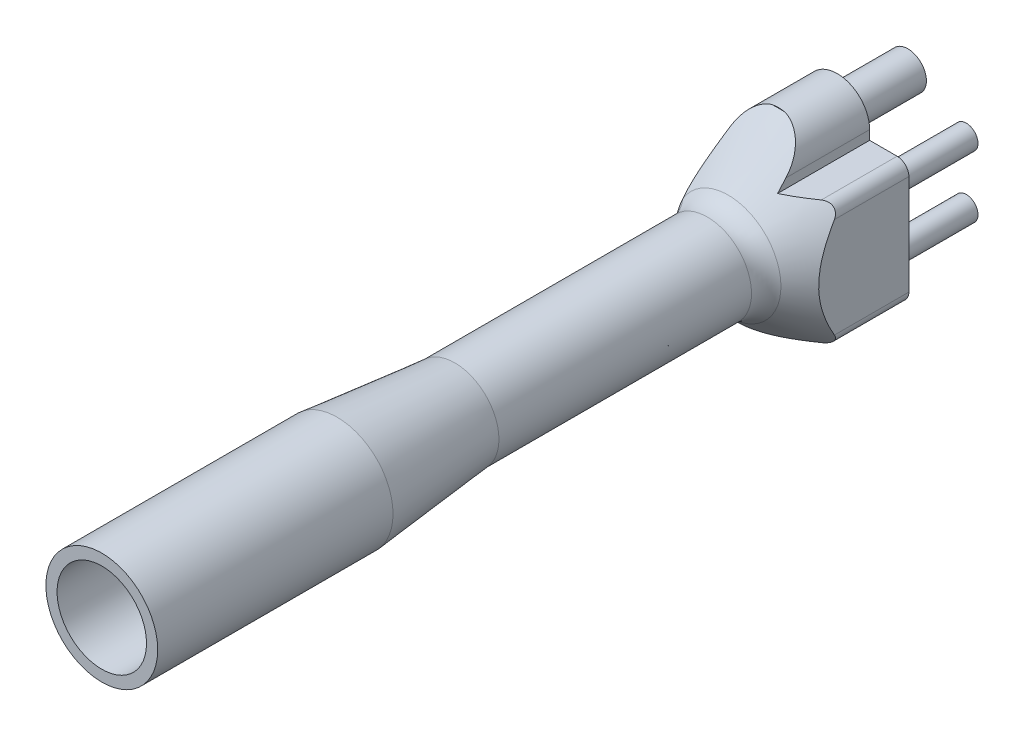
ISO-10303-21;
HEADER;
FILE_DESCRIPTION(('STEP AP214'),'2;1');
FILE_NAME('part.step','',(''),(''),'','','');
FILE_SCHEMA(('AUTOMOTIVE_DESIGN { 1 0 10303 214 1 1 1 1 }'));
ENDSEC;
DATA;
#1=APPLICATION_CONTEXT('core data for automotive mechanical design processes');
#2=APPLICATION_PROTOCOL_DEFINITION('international standard','automotive_design',2000,#1);
#3=PRODUCT_CONTEXT('',#1,'mechanical');
#4=PRODUCT('Part','Part','',(#3));
#5=PRODUCT_RELATED_PRODUCT_CATEGORY('part','',(#4));
#6=PRODUCT_DEFINITION_FORMATION('','',#4);
#7=PRODUCT_DEFINITION_CONTEXT('part definition',#1,'design');
#8=PRODUCT_DEFINITION('design','',#6,#7);
#9=PRODUCT_DEFINITION_SHAPE('','',#8);
#10=(LENGTH_UNIT() NAMED_UNIT(*) SI_UNIT(.MILLI.,.METRE.));
#11=(NAMED_UNIT(*) PLANE_ANGLE_UNIT() SI_UNIT($,.RADIAN.));
#12=(NAMED_UNIT(*) SI_UNIT($,.STERADIAN.) SOLID_ANGLE_UNIT());
#13=UNCERTAINTY_MEASURE_WITH_UNIT(LENGTH_MEASURE(1.E-05),#10,'distance_accuracy_value','');
#14=(GEOMETRIC_REPRESENTATION_CONTEXT(3) GLOBAL_UNCERTAINTY_ASSIGNED_CONTEXT((#13)) GLOBAL_UNIT_ASSIGNED_CONTEXT((#10,
#11,#12)) REPRESENTATION_CONTEXT('',''));
#15=CARTESIAN_POINT('',(0.,0.,0.));
#16=DIRECTION('',(0.,0.,1.));
#17=DIRECTION('',(1.,0.,0.));
#18=AXIS2_PLACEMENT_3D('',#15,#16,#17);
#19=CARTESIAN_POINT('',(0.,0.,125.));
#20=DIRECTION('',(0.,0.,-1.));
#21=DIRECTION('',(-1.,0.,0.));
#22=AXIS2_PLACEMENT_3D('',#19,#20,#21);
#23=CYLINDRICAL_SURFACE('',#22,7.5);
#24=CARTESIAN_POINT('',(0.,0.,65.));
#25=DIRECTION('',(0.,0.,1.));
#26=DIRECTION('',(1.,0.,0.));
#27=AXIS2_PLACEMENT_3D('',#24,#25,#26);
#28=CIRCLE('',#27,7.5);
#29=CARTESIAN_POINT('',(7.5,0.,65.));
#30=VERTEX_POINT('',#29);
#31=EDGE_CURVE('E333',#30,#30,#28,.T.);
#32=ORIENTED_EDGE('',*,*,#31,.F.);
#33=EDGE_LOOP('',(#32));
#34=FACE_BOUND('',#33,.T.);
#35=CARTESIAN_POINT('',(0.,0.,22.0710678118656));
#36=DIRECTION('',(0.,0.,1.));
#37=DIRECTION('',(1.,0.,0.));
#38=AXIS2_PLACEMENT_3D('',#35,#36,#37);
#39=CIRCLE('',#38,7.5);
#40=CARTESIAN_POINT('',(-6.30688504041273,-4.05871914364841,22.0710678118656));
#41=VERTEX_POINT('',#40);
#42=CARTESIAN_POINT('',(-6.47395906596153,3.78653588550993,22.0710678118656));
#43=VERTEX_POINT('',#42);
#44=EDGE_CURVE('E315',#41,#43,#39,.T.);
#45=ORIENTED_EDGE('',*,*,#44,.T.);
#46=CARTESIAN_POINT('',(-5.77299968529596,4.78774212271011,22.0124920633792));
#47=CARTESIAN_POINT('',(-5.87457917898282,4.66525883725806,19.6019201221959));
#48=CARTESIAN_POINT('',(-7.39453584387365,5.7973350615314,18.1038170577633));
#49=CARTESIAN_POINT('',(-5.8383342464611,4.70896666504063,22.0237574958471));
#50=CARTESIAN_POINT('',(-5.92510738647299,4.60094988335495,19.6437087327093));
#51=CARTESIAN_POINT('',(-7.4221893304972,5.6949909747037,18.1451944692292));
#52=CARTESIAN_POINT('',(-5.90209692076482,4.62879684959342,22.033072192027));
#53=CARTESIAN_POINT('',(-5.97603409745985,4.53416342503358,19.683439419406));
#54=CARTESIAN_POINT('',(-7.45010655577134,5.59167080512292,18.1854560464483));
#55=CARTESIAN_POINT('',(-6.02631754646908,4.46586797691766,22.0483240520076));
#56=CARTESIAN_POINT('',(-6.07780764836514,4.39600396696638,19.7585436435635));
#57=CARTESIAN_POINT('',(-7.50649017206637,5.38299803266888,18.2634489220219));
#58=CARTESIAN_POINT('',(-6.0867766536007,4.38310984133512,22.0542624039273));
#59=CARTESIAN_POINT('',(-6.12866993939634,4.32463350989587,19.793950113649));
#60=CARTESIAN_POINT('',(-7.53495636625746,5.27764615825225,18.3011811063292));
#61=CARTESIAN_POINT('',(-6.20368283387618,4.21599514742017,22.0632471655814));
#62=CARTESIAN_POINT('',(-6.22926990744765,4.1780297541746,19.8601317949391));
#63=CARTESIAN_POINT('',(-7.5921889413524,5.06583143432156,18.3734796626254));
#64=CARTESIAN_POINT('',(-6.2601642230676,4.13166313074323,22.0663221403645));
#65=CARTESIAN_POINT('',(-6.27903087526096,4.1028408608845,19.8909777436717));
#66=CARTESIAN_POINT('',(-7.62094939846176,4.95939050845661,18.408074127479));
#67=CARTESIAN_POINT('',(-6.36967569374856,3.96074959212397,22.0702330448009));
#68=CARTESIAN_POINT('',(-6.37741314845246,3.94805322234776,19.948527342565));
#69=CARTESIAN_POINT('',(-7.67906382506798,4.74431209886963,18.4741927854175));
#70=CARTESIAN_POINT('',(-6.42270498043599,3.87416755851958,22.071068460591));
#71=CARTESIAN_POINT('',(-6.42605708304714,3.86844160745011,19.9752569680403));
#72=CARTESIAN_POINT('',(-7.70841792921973,4.63567411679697,18.5057162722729));
#73=CARTESIAN_POINT('',(-6.57528322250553,3.61329690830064,22.0710665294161));
#74=CARTESIAN_POINT('',(-6.56816431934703,3.62545801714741,20.048659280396));
#75=CARTESIAN_POINT('',(-7.79671223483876,4.30890157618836,18.594477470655));
#76=CARTESIAN_POINT('',(-6.66966966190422,3.43595580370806,22.0677977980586));
#77=CARTESIAN_POINT('',(-6.65961509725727,3.45530595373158,20.0896915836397));
#78=CARTESIAN_POINT('',(-7.85654151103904,4.08747659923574,18.6467515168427));
#79=CARTESIAN_POINT('',(-6.8439405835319,3.07421609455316,22.0592716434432));
#80=CARTESIAN_POINT('',(-6.83205083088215,3.10040954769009,20.1564977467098));
#81=CARTESIAN_POINT('',(-7.97837205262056,3.63658822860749,18.734914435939));
#82=CARTESIAN_POINT('',(-6.92381876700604,2.88981446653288,22.0540133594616));
#83=CARTESIAN_POINT('',(-6.9132507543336,2.91538984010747,20.1824066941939));
#84=CARTESIAN_POINT('',(-8.04037424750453,3.40712139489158,18.7707962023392));
#85=CARTESIAN_POINT('',(-7.03307478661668,2.60698265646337,22.0475275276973));
#86=CARTESIAN_POINT('',(-7.02548321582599,2.62754265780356,20.2105434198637));
#87=CARTESIAN_POINT('',(-8.13515554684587,3.05634083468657,18.8105206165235));
#88=CARTESIAN_POINT('',(-7.06802546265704,2.51067939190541,22.045587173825));
#89=CARTESIAN_POINT('',(-7.06160746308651,2.52887358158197,20.218161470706));
#90=CARTESIAN_POINT('',(-8.16737453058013,2.93710008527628,18.8214479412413));
#91=CARTESIAN_POINT('',(-7.13395673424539,2.31671138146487,22.042543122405));
#92=CARTESIAN_POINT('',(-7.12990255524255,2.32932525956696,20.2296676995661));
#93=CARTESIAN_POINT('',(-8.23205242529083,2.69773062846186,18.8380632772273));
#94=CARTESIAN_POINT('',(-7.16493729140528,2.21904662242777,22.0414394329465));
#95=CARTESIAN_POINT('',(-7.16209733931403,2.22838884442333,20.2335627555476));
#96=CARTESIAN_POINT('',(-8.264511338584,2.57760191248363,18.843751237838));
#97=CARTESIAN_POINT('',(-7.22286394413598,2.02255397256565,22.0402821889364));
#98=CARTESIAN_POINT('',(-7.22222602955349,2.02500881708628,20.2376614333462));
#99=CARTESIAN_POINT('',(-8.32951498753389,2.33702685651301,18.8497366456));
#100=CARTESIAN_POINT('',(-7.24981106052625,1.92372638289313,22.0402283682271));
#101=CARTESIAN_POINT('',(-7.25018069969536,1.92250437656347,20.2378684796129));
#102=CARTESIAN_POINT('',(-8.36205969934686,2.21658060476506,18.8500354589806));
#103=CARTESIAN_POINT('',(-7.29963632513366,1.7250516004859,22.0411405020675));
#104=CARTESIAN_POINT('',(-7.30166277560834,1.71671916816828,20.2345974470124));
#105=CARTESIAN_POINT('',(-8.42707601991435,1.97595865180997,18.8452671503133));
#106=CARTESIAN_POINT('',(-7.3225144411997,1.62520439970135,22.0421064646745));
#107=CARTESIAN_POINT('',(-7.32520454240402,1.61337588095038,20.2311173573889));
#108=CARTESIAN_POINT('',(-8.45954762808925,1.855782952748,18.8401999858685));
#109=CARTESIAN_POINT('',(-7.34333589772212,1.52493209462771,22.0435674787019));
#110=CARTESIAN_POINT('',(-7.34642289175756,1.51006662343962,20.2257889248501));
#111=CARTESIAN_POINT('',(-8.49189886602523,1.73605273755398,18.8324603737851));
#112=(BOUNDED_SURFACE() B_SPLINE_SURFACE(3,2,((#46,#47,#48),(#49,#50,#51),(#52,#53,#54),(#55,
#56,#57),(#58,#59,#60),(#61,#62,#63),(#64,#65,#66),(#67,#68,#69),(#70,#71,#72),(#73,#74,#75),
(#76,#77,#78),(#79,#80,#81),(#82,#83,#84),(#85,#86,#87),(#88,#89,#90),(#91,#92,#93),(#94,#95,
#96),(#97,#98,#99),(#100,#101,#102),(#103,#104,#105),(#106,#107,#108),(#109,#110,#111)),
.UNSPECIFIED.,.F.,.F.,.F.) B_SPLINE_SURFACE_WITH_KNOTS((4,2,2,2,2,2,2,2,2,2,4),(3,3),(0.,
0.512766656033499,1.02535276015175,1.53276873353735,2.04030112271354,3.04364145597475,
4.04741635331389,4.55957373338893,5.07173606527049,5.58376855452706,6.09580508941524),(0.,1.),
.UNSPECIFIED.) GEOMETRIC_REPRESENTATION_ITEM() RATIONAL_B_SPLINE_SURFACE(((1.,0.900408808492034,
1.),(1.,0.902659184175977,1.),(1.,0.904850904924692,1.),(1.,0.909097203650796,1.),(1.,
0.911151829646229,1.),(1.,0.915085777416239,1.),(1.,0.916966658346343,1.),(1.,0.920556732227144,
1.),(1.,0.922265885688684,1.),(1.,0.927069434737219,1.),(1.,0.929885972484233,1.),(1.,
0.934618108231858,1.),(1.,0.936533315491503,1.),(1.,0.938648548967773,1.),(1.,0.939229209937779,
1.),(1.,0.940111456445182,1.),(1.,0.940413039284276,1.),(1.,0.940730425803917,1.),(1.,
0.940746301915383,1.),(1.,0.940493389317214,1.),(1.,0.940224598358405,1.),(1.,0.939813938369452,1.))) REPRESENTATION_ITEM('') SURFACE());
#113=CARTESIAN_POINT('',(-5.77299968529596,4.78774212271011,22.0124920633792));
#114=CARTESIAN_POINT('',(-5.8383342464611,4.70896666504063,22.0237574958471));
#115=CARTESIAN_POINT('',(-5.90209692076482,4.62879684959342,22.033072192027));
#116=CARTESIAN_POINT('',(-6.02631754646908,4.46586797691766,22.0483240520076));
#117=CARTESIAN_POINT('',(-6.0867766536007,4.38310984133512,22.0542624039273));
#118=CARTESIAN_POINT('',(-6.20368283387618,4.21599514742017,22.0632471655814));
#119=CARTESIAN_POINT('',(-6.2601642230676,4.13166313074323,22.0663221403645));
#120=CARTESIAN_POINT('',(-6.36967569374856,3.96074959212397,22.0702330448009));
#121=CARTESIAN_POINT('',(-6.42270498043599,3.87416755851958,22.071068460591));
#122=CARTESIAN_POINT('',(-6.57528322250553,3.61329690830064,22.0710665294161));
#123=CARTESIAN_POINT('',(-6.66966966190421,3.43595580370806,22.0677977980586));
#124=CARTESIAN_POINT('',(-6.8439405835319,3.07421609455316,22.0592716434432));
#125=CARTESIAN_POINT('',(-6.92381876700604,2.88981446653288,22.0540133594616));
#126=CARTESIAN_POINT('',(-7.03307478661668,2.60698265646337,22.0475275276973));
#127=CARTESIAN_POINT('',(-7.06802546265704,2.51067939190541,22.045587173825));
#128=CARTESIAN_POINT('',(-7.13395673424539,2.31671138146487,22.042543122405));
#129=CARTESIAN_POINT('',(-7.16493729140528,2.21904662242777,22.0414394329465));
#130=CARTESIAN_POINT('',(-7.22286394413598,2.02255397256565,22.0402821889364));
#131=CARTESIAN_POINT('',(-7.24981106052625,1.92372638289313,22.0402283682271));
#132=CARTESIAN_POINT('',(-7.29963632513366,1.7250516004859,22.0411405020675));
#133=CARTESIAN_POINT('',(-7.3225144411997,1.62520439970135,22.0421064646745));
#134=CARTESIAN_POINT('',(-7.34333589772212,1.52493209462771,22.0435674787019));
#135=B_SPLINE_CURVE_WITH_KNOTS('',3,(#113,#114,#115,#116,#117,#118,#119,#120,#121,#122,#123,
#124,#125,#126,#127,#128,#129,#130,#131,#132,#133,#134),.UNSPECIFIED.,.F.,.F.,(4,2,2,2,2,2,2,2,
2,2,4),(0.,0.512766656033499,1.02535276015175,1.53276873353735,2.04030112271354,
3.04364145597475,4.04741635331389,4.55957373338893,5.07173606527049,5.58376855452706,
6.09580508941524),.UNSPECIFIED.);
#136=CARTESIAN_POINT('',(-6.94841642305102,2.82303191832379,22.0525976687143));
#137=VERTEX_POINT('',#136);
#138=EDGE_CURVE('E71',#43,#137,#135,.T.);
#139=ORIENTED_EDGE('',*,*,#138,.T.);
#140=CARTESIAN_POINT('',(-5.92732893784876,4.59529886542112,22.0656069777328));
#141=CARTESIAN_POINT('',(-5.94108954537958,4.57754949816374,19.8815291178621));
#142=CARTESIAN_POINT('',(-7.2168893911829,5.54733282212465,18.3974281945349));
#143=CARTESIAN_POINT('',(-6.03000547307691,4.4628749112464,22.0684873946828));
#144=CARTESIAN_POINT('',(-6.03919425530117,4.45019617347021,19.9141336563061));
#145=CARTESIAN_POINT('',(-7.30520988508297,5.37194266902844,18.4342757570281));
#146=CARTESIAN_POINT('',(-6.12823191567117,4.32699567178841,22.0701540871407));
#147=CARTESIAN_POINT('',(-6.13376741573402,4.31895958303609,19.9449176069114));
#148=CARTESIAN_POINT('',(-7.38857109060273,5.19498225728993,18.4699289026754));
#149=CARTESIAN_POINT('',(-6.31535838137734,4.04898549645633,22.071405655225));
#150=CARTESIAN_POINT('',(-6.31478375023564,4.04965235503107,20.0026886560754));
#151=CARTESIAN_POINT('',(-7.54575582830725,4.83799879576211,18.538548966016));
#152=CARTESIAN_POINT('',(-6.4042597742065,3.90685548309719,22.0709908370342));
#153=CARTESIAN_POINT('',(-6.40129095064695,3.91156526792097,20.029701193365));
#154=CARTESIAN_POINT('',(-7.61958076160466,4.65797620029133,18.5715162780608));
#155=CARTESIAN_POINT('',(-6.5723586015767,3.61693183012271,22.068425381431));
#156=CARTESIAN_POINT('',(-6.56571793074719,3.62879446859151,20.0799784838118));
#157=CARTESIAN_POINT('',(-7.7581146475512,4.29485520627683,18.634485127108));
#158=CARTESIAN_POINT('',(-6.65155392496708,3.46913696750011,22.0662743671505));
#159=CARTESIAN_POINT('',(-6.64369708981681,3.48408197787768,20.1032652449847));
#160=CARTESIAN_POINT('',(-7.82282161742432,4.11175614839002,18.6644860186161));
#161=CARTESIAN_POINT('',(-6.79987119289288,3.16857064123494,22.0607171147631));
#162=CARTESIAN_POINT('',(-6.79042759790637,3.18868205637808,20.1461676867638));
#163=CARTESIAN_POINT('',(-7.94325522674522,3.74288124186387,18.721181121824));
#164=CARTESIAN_POINT('',(-6.86899205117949,3.01579864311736,22.0573107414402));
#165=CARTESIAN_POINT('',(-6.85923711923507,3.03795475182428,20.1658034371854));
#166=CARTESIAN_POINT('',(-7.99898089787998,3.55710510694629,18.7478749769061));
#167=CARTESIAN_POINT('',(-7.00783597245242,2.67932837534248,22.0490956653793));
#168=CARTESIAN_POINT('',(-6.99804651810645,2.70478488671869,20.204607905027));
#169=CARTESIAN_POINT('',(-8.11043054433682,3.15085314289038,18.8019455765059));
#170=CARTESIAN_POINT('',(-7.07562054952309,2.49482777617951,22.0441465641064));
#171=CARTESIAN_POINT('',(-7.06633900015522,2.52117505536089,20.2231533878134));
#172=CARTESIAN_POINT('',(-8.16450796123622,2.92990143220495,18.8286510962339));
#173=CARTESIAN_POINT('',(-7.19650145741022,2.1210722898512,22.0341046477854));
#174=CARTESIAN_POINT('',(-7.18863443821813,2.14774112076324,20.2556582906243));
#175=CARTESIAN_POINT('',(-8.26062100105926,2.48502232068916,18.8766590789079));
#176=CARTESIAN_POINT('',(-7.24959701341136,1.93181715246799,22.0290118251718));
#177=CARTESIAN_POINT('',(-7.24271332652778,1.95781736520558,20.2696399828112));
#178=CARTESIAN_POINT('',(-8.30265598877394,2.26109476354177,18.897961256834));
#179=CARTESIAN_POINT('',(-7.340786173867,1.54966506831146,22.0195402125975));
#180=CARTESIAN_POINT('',(-7.33587409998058,1.573093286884,20.2933140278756));
#181=CARTESIAN_POINT('',(-8.37470816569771,1.81078852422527,18.9347748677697));
#182=CARTESIAN_POINT('',(-7.37887537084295,1.35676706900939,22.015161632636));
#183=CARTESIAN_POINT('',(-7.37501312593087,1.37817502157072,20.3030217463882));
#184=CARTESIAN_POINT('',(-8.40472182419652,1.5844091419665,18.9502845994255));
#185=CARTESIAN_POINT('',(-7.43979338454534,0.968540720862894,22.0078501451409));
#186=CARTESIAN_POINT('',(-7.4377161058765,0.984979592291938,20.3184029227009));
#187=CARTESIAN_POINT('',(-8.45268394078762,1.129824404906,18.9751914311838));
#188=CARTESIAN_POINT('',(-7.46262190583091,0.773212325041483,22.0049172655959));
#189=CARTESIAN_POINT('',(-7.46132279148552,0.786572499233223,20.3240871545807));
#190=CARTESIAN_POINT('',(-8.47063216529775,0.901619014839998,18.9845884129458));
#191=CARTESIAN_POINT('',(-7.48586064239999,0.472238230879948,22.001880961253));
#192=CARTESIAN_POINT('',(-7.48536030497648,0.480577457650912,20.3298446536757));
#193=CARTESIAN_POINT('',(-8.48889371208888,0.550489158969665,18.9941621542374));
#194=CARTESIAN_POINT('',(-7.49175747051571,0.366989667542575,22.0010961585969));
#195=CARTESIAN_POINT('',(-7.49146478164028,0.373516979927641,20.3312982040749));
#196=CARTESIAN_POINT('',(-8.49352497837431,0.427795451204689,18.9965937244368));
#197=CARTESIAN_POINT('',(-7.49911070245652,0.15633759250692,22.0001157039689));
#198=CARTESIAN_POINT('',(-7.49907728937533,0.159151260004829,20.3331102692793));
#199=CARTESIAN_POINT('',(-8.49930037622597,0.182217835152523,18.9996278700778));
#200=CARTESIAN_POINT('',(-7.50056741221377,0.0509340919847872,21.9999200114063));
#201=CARTESIAN_POINT('',(-7.5005871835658,0.0518243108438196,20.3334692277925));
#202=CARTESIAN_POINT('',(-8.50044474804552,0.0593339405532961,19.0002305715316));
#203=CARTESIAN_POINT('',(-7.49903720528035,-0.159843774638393,22.000127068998));
#204=CARTESIAN_POINT('',(-7.49900305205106,-0.162714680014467,20.3330946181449));
#205=CARTESIAN_POINT('',(-8.49924383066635,-0.186324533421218,18.9996008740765));
#206=CARTESIAN_POINT('',(-7.49605008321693,-0.265218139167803,22.0005298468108));
#207=CARTESIAN_POINT('',(-7.49590849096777,-0.269948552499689,20.3323609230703));
#208=CARTESIAN_POINT('',(-8.49689838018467,-0.309099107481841,18.9983683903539));
#209=CARTESIAN_POINT('',(-7.48563734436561,-0.475755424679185,22.0019075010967));
#210=CARTESIAN_POINT('',(-7.48513131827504,-0.484118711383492,20.3297882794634));
#211=CARTESIAN_POINT('',(-8.48871851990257,-0.554556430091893,18.9940705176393));
#212=CARTESIAN_POINT('',(-7.47821132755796,-0.58091832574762,22.0028824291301));
#213=CARTESIAN_POINT('',(-7.47744610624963,-0.591076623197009,20.3279487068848));
#214=CARTESIAN_POINT('',(-8.48288379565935,-0.677239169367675,18.9910049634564));
#215=CARTESIAN_POINT('',(-7.4589324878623,-0.790845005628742,22.0053694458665));
#216=CARTESIAN_POINT('',(-7.45752022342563,-0.804396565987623,20.3231571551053));
#217=CARTESIAN_POINT('',(-8.46772753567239,-0.922323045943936,18.9830684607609));
#218=CARTESIAN_POINT('',(-7.44707933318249,-0.8956087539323,22.0068815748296));
#219=CARTESIAN_POINT('',(-7.44527519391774,-0.910779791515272,20.3202041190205));
#220=CARTESIAN_POINT('',(-8.45840573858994,-1.04472416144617,18.9781973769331));
#221=CARTESIAN_POINT('',(-7.41897055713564,-1.10453140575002,22.0103584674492));
#222=CARTESIAN_POINT('',(-7.41629736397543,-1.12263703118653,20.3131546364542));
#223=CARTESIAN_POINT('',(-8.43629139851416,-1.28903045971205,18.9666773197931));
#224=CARTESIAN_POINT('',(-7.4027150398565,-1.20869032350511,22.0123232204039));
#225=CARTESIAN_POINT('',(-7.39955891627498,-1.22813150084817,20.309056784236));
#226=CARTESIAN_POINT('',(-8.42349893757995,-1.41093565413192,18.9600283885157));
#227=CARTESIAN_POINT('',(-7.34738141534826,-1.51999701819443,22.0187674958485));
#228=CARTESIAN_POINT('',(-7.34267697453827,-1.54309344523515,20.2949950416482));
#229=CARTESIAN_POINT('',(-8.37990877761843,-1.77587920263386,18.9374713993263));
#230=CARTESIAN_POINT('',(-7.30173263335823,-1.72601390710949,22.0237975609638));
#231=CARTESIAN_POINT('',(-7.29586487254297,-1.75093296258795,20.2832621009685));
#232=CARTESIAN_POINT('',(-8.34389548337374,-2.01819114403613,18.9189516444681));
#233=CARTESIAN_POINT('',(-7.19335399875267,-2.13306158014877,22.0343511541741));
#234=CARTESIAN_POINT('',(-7.18546864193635,-2.15979355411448,20.254807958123));
#235=CARTESIAN_POINT('',(-8.25810155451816,-2.49928718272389,18.8754121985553));
#236=CARTESIAN_POINT('',(-7.13065583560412,-2.33410086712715,22.0398737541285));
#237=CARTESIAN_POINT('',(-7.12183309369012,-2.3609638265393,20.2380731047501));
#238=CARTESIAN_POINT('',(-8.20834645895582,-2.7380769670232,18.8504045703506));
#239=CARTESIAN_POINT('',(-6.98857725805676,-2.73021121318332,22.0503535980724));
#240=CARTESIAN_POINT('',(-6.97873600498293,-2.75537600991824,20.1992781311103));
#241=CARTESIAN_POINT('',(-8.09499792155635,-3.21200338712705,18.7944019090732));
#242=CARTESIAN_POINT('',(-6.90919673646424,-2.92528223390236,22.0553108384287));
#243=CARTESIAN_POINT('',(-6.89917392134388,-2.9487305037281,20.1771874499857));
#244=CARTESIAN_POINT('',(-8.03140439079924,-3.44713999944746,18.7634068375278));
#245=CARTESIAN_POINT('',(-6.73431208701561,-3.30806895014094,22.0635682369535));
#246=CARTESIAN_POINT('',(-6.72533389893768,-3.32620407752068,20.1273697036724));
#247=CARTESIAN_POINT('',(-7.89020450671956,-3.91323228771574,18.6959968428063));
#248=CARTESIAN_POINT('',(-6.63880801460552,-3.49578467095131,22.0668684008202));
#249=CARTESIAN_POINT('',(-6.63094281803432,-3.51040920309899,20.0996047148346));
#250=CARTESIAN_POINT('',(-7.81259820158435,-4.14418797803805,18.6595819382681));
#251=CARTESIAN_POINT('',(-6.43235380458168,-3.86252550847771,22.0708858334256));
#252=CARTESIAN_POINT('',(-6.42854909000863,-3.86862823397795,20.0382291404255));
#253=CARTESIAN_POINT('',(-7.64296280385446,-4.60163118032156,18.5819236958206));
#254=CARTESIAN_POINT('',(-6.32140411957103,-4.04155087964,22.0716031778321));
#255=CARTESIAN_POINT('',(-6.32042525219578,-4.04270245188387,20.0045740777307));
#256=CARTESIAN_POINT('',(-7.55093413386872,-4.82811882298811,18.5406804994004));
#257=CARTESIAN_POINT('',(-6.08483257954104,-4.3896584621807,22.0696801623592));
#258=CARTESIAN_POINT('',(-6.09170144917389,-4.37984143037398,19.9313655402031));
#259=CARTESIAN_POINT('',(-7.35189256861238,-5.27609630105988,18.4540366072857));
#260=CARTESIAN_POINT('',(-5.95920894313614,-4.55873946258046,22.0670393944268));
#261=CARTESIAN_POINT('',(-5.97097607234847,-4.54293680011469,19.8917619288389));
#262=CARTESIAN_POINT('',(-7.24487785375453,-5.49758552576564,18.4086354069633));
#263=CARTESIAN_POINT('',(-5.69421362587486,-4.88571618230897,22.0578891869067));
#264=CARTESIAN_POINT('',(-5.71806841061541,-4.85757256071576,19.8067589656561));
#265=CARTESIAN_POINT('',(-7.01503150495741,-5.93506569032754,18.3143208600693));
#266=CARTESIAN_POINT('',(-5.55484173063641,-5.04361172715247,22.0513796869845));
#267=CARTESIAN_POINT('',(-5.58576281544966,-5.00911978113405,19.7613071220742));
#268=CARTESIAN_POINT('',(-6.89219962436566,-6.15105654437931,18.2654074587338));
#269=CARTESIAN_POINT('',(-5.26315539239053,-5.34729479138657,22.0342328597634));
#270=CARTESIAN_POINT('',(-5.31025796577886,-5.30057024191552,19.6648581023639));
#271=CARTESIAN_POINT('',(-6.62929747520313,-6.57723898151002,18.1647215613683));
#272=CARTESIAN_POINT('',(-5.11082483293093,-5.49306677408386,22.023590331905));
#273=CARTESIAN_POINT('',(-5.16692671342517,-5.4404410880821,19.6138018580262));
#274=CARTESIAN_POINT('',(-6.48920564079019,-6.78742289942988,18.1129455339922));
#275=CARTESIAN_POINT('',(-4.87362673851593,-5.70165442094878,22.0046126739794));
#276=CARTESIAN_POINT('',(-4.9447273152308,-5.64078496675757,19.5337196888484));
#277=CARTESIAN_POINT('',(-6.26525564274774,-7.09721477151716,18.0338364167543));
#278=CARTESIAN_POINT('',(-4.79309868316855,-5.76951386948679,21.9977833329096));
#279=CARTESIAN_POINT('',(-4.86924826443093,-5.70615309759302,19.5063646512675));
#280=CARTESIAN_POINT('',(-6.18829209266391,-7.19957839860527,18.0072221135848));
#281=CARTESIAN_POINT('',(-4.62927536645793,-5.90177000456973,21.9831602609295));
#282=CARTESIAN_POINT('',(-4.71576593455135,-5.83383564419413,19.4505520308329));
#283=CARTESIAN_POINT('',(-6.0295212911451,-7.4023060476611,17.9536324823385));
#284=CARTESIAN_POINT('',(-4.54598005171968,-5.96616662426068,21.9753665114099));
#285=CARTESIAN_POINT('',(-4.63774957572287,-5.89614357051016,19.42208906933));
#286=CARTESIAN_POINT('',(-5.94771394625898,-7.50267003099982,17.9266571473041));
#287=CARTESIAN_POINT('',(-4.46136661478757,-6.02878162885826,21.9671107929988));
#288=CARTESIAN_POINT('',(-4.55861314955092,-5.95681809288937,19.3931822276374));
#289=CARTESIAN_POINT('',(-5.86336421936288,-7.60195164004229,17.8995610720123));
#290=(BOUNDED_SURFACE() B_SPLINE_SURFACE(3,2,((#140,#141,#142),(#143,#144,#145),(#146,#147,
#148),(#149,#150,#151),(#152,#153,#154),(#155,#156,#157),(#158,#159,#160),(#161,#162,#163),
(#164,#165,#166),(#167,#168,#169),(#170,#171,#172),(#173,#174,#175),(#176,#177,#178),(#179,#180,
#181),(#182,#183,#184),(#185,#186,#187),(#188,#189,#190),(#191,#192,#193),(#194,#195,#196),
(#197,#198,#199),(#200,#201,#202),(#203,#204,#205),(#206,#207,#208),(#209,#210,#211),(#212,#213,
#214),(#215,#216,#217),(#218,#219,#220),(#221,#222,#223),(#224,#225,#226),(#227,#228,#229),
(#230,#231,#232),(#233,#234,#235),(#236,#237,#238),(#239,#240,#241),(#242,#243,#244),(#245,#246,
#247),(#248,#249,#250),(#251,#252,#253),(#254,#255,#256),(#257,#258,#259),(#260,#261,#262),
(#263,#264,#265),(#266,#267,#268),(#269,#270,#271),(#272,#273,#274),(#275,#276,#277),(#278,#279,
#280),(#281,#282,#283),(#284,#285,#286),(#287,#288,#289)),.UNSPECIFIED.,.F.,.F.,
.F.) B_SPLINE_SURFACE_WITH_KNOTS((4,2,2,2,2,2,2,2,2,2,2,2,2,2,2,2,2,2,2,2,2,2,2,2,4),(3,3),(0.,
0.837709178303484,1.67529513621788,2.5130629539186,3.35092103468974,4.33278921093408,
5.31470916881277,6.29691730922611,7.27914446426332,7.80608540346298,8.33299003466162,
8.85991901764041,9.38689549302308,9.91391147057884,10.4409149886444,11.4947259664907,
12.5465914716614,13.5984637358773,14.6503323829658,15.70217021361,16.7541358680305,
17.8061179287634,18.8594280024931,19.3862276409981,19.913037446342),(0.,1.),
.UNSPECIFIED.) GEOMETRIC_REPRESENTATION_ITEM() RATIONAL_B_SPLINE_SURFACE(((1.,0.91637973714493,
1.),(1.,0.918387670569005,1.),(1.,0.920324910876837,1.),(1.,0.924044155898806,1.),(1.,
0.925826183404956,1.),(1.,0.929222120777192,1.),(1.,0.93083599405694,1.),(1.,0.933878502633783,
1.),(1.,0.935307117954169,1.),(1.,0.938194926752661,1.),(1.,0.939617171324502,1.),(1.,
0.942168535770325,1.),(1.,0.94329764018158,1.),(1.,0.945245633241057,1.),(1.,0.946064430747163,
1.),(1.,0.947377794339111,1.),(1.,0.947872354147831,1.),(1.,0.948376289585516,1.),(1.,
0.948504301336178,1.),(1.,0.948663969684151,1.),(1.,0.948695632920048,1.),(1.,0.948662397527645,
1.),(1.,0.948597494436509,1.),(1.,0.948371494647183,1.),(1.,0.948210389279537,1.),(1.,
0.947792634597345,1.),(1.,0.947535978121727,1.),(1.,0.946928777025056,1.),(1.,0.94657823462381,
1.),(1.,0.945387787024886,1.),(1.,0.94440898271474,1.),(1.,0.942102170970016,1.),(1.,
0.940774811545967,1.),(1.,0.93779278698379,1.),(1.,0.936138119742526,1.),(1.,0.932528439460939,
1.),(1.,0.930573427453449,1.),(1.,0.92638972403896,1.),(1.,0.924161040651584,1.),(1.,
0.919462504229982,1.),(1.,0.916992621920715,1.),(1.,0.911843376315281,1.),(1.,0.909164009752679,
1.),(1.,0.903627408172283,1.),(1.,0.900769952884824,1.),(1.,0.896384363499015,1.),(1.,
0.894905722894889,1.),(1.,0.891921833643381,1.),(1.,0.890416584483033,1.),(1.,0.888901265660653,1.))) REPRESENTATION_ITEM('') SURFACE());
#291=CARTESIAN_POINT('',(-5.92732893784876,4.59529886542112,22.0656069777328));
#292=CARTESIAN_POINT('',(-6.03000547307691,4.4628749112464,22.0684873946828));
#293=CARTESIAN_POINT('',(-6.12823191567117,4.32699567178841,22.0701540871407));
#294=CARTESIAN_POINT('',(-6.31535838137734,4.04898549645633,22.071405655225));
#295=CARTESIAN_POINT('',(-6.4042597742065,3.90685548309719,22.0709908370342));
#296=CARTESIAN_POINT('',(-6.5723586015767,3.61693183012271,22.068425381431));
#297=CARTESIAN_POINT('',(-6.65155392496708,3.46913696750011,22.0662743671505));
#298=CARTESIAN_POINT('',(-6.79987119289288,3.16857064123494,22.0607171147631));
#299=CARTESIAN_POINT('',(-6.86899205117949,3.01579864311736,22.0573107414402));
#300=CARTESIAN_POINT('',(-7.00783597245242,2.67932837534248,22.0490956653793));
#301=CARTESIAN_POINT('',(-7.07562054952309,2.49482777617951,22.0441465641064));
#302=CARTESIAN_POINT('',(-7.19650145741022,2.1210722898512,22.0341046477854));
#303=CARTESIAN_POINT('',(-7.24959701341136,1.93181715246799,22.0290118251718));
#304=CARTESIAN_POINT('',(-7.340786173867,1.54966506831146,22.0195402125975));
#305=CARTESIAN_POINT('',(-7.37887537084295,1.35676706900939,22.015161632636));
#306=CARTESIAN_POINT('',(-7.43979338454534,0.968540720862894,22.0078501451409));
#307=CARTESIAN_POINT('',(-7.46262190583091,0.773212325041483,22.0049172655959));
#308=CARTESIAN_POINT('',(-7.48586064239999,0.472238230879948,22.001880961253));
#309=CARTESIAN_POINT('',(-7.49175747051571,0.366989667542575,22.0010961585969));
#310=CARTESIAN_POINT('',(-7.49911070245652,0.15633759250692,22.0001157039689));
#311=CARTESIAN_POINT('',(-7.50056741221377,0.0509340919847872,21.9999200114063));
#312=CARTESIAN_POINT('',(-7.49903720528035,-0.159843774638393,22.000127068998));
#313=CARTESIAN_POINT('',(-7.49605008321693,-0.265218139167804,22.0005298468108));
#314=CARTESIAN_POINT('',(-7.48563734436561,-0.475755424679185,22.0019075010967));
#315=CARTESIAN_POINT('',(-7.47821132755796,-0.58091832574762,22.0028824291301));
#316=CARTESIAN_POINT('',(-7.4589324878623,-0.790845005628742,22.0053694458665));
#317=CARTESIAN_POINT('',(-7.44707933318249,-0.8956087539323,22.0068815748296));
#318=CARTESIAN_POINT('',(-7.41897055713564,-1.10453140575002,22.0103584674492));
#319=CARTESIAN_POINT('',(-7.4027150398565,-1.20869032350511,22.0123232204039));
#320=CARTESIAN_POINT('',(-7.34738141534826,-1.51999701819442,22.0187674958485));
#321=CARTESIAN_POINT('',(-7.30173263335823,-1.72601390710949,22.0237975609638));
#322=CARTESIAN_POINT('',(-7.19335399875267,-2.13306158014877,22.0343511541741));
#323=CARTESIAN_POINT('',(-7.13065583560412,-2.33410086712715,22.0398737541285));
#324=CARTESIAN_POINT('',(-6.98857725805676,-2.73021121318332,22.0503535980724));
#325=CARTESIAN_POINT('',(-6.90919673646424,-2.92528223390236,22.0553108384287));
#326=CARTESIAN_POINT('',(-6.73431208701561,-3.30806895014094,22.0635682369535));
#327=CARTESIAN_POINT('',(-6.63880801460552,-3.49578467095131,22.0668684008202));
#328=CARTESIAN_POINT('',(-6.43235380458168,-3.86252550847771,22.0708858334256));
#329=CARTESIAN_POINT('',(-6.32140411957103,-4.04155087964,22.0716031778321));
#330=CARTESIAN_POINT('',(-6.08483257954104,-4.3896584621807,22.0696801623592));
#331=CARTESIAN_POINT('',(-5.95920894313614,-4.55873946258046,22.0670393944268));
#332=CARTESIAN_POINT('',(-5.69421362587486,-4.88571618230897,22.0578891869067));
#333=CARTESIAN_POINT('',(-5.55484173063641,-5.04361172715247,22.0513796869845));
#334=CARTESIAN_POINT('',(-5.26315539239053,-5.34729479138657,22.0342328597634));
#335=CARTESIAN_POINT('',(-5.11082483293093,-5.49306677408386,22.023590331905));
#336=CARTESIAN_POINT('',(-4.87362673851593,-5.70165442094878,22.0046126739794));
#337=CARTESIAN_POINT('',(-4.79309868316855,-5.76951386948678,21.9977833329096));
#338=CARTESIAN_POINT('',(-4.62927536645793,-5.90177000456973,21.9831602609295));
#339=CARTESIAN_POINT('',(-4.54598005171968,-5.96616662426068,21.9753665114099));
#340=CARTESIAN_POINT('',(-4.46136661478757,-6.02878162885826,21.9671107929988));
#341=B_SPLINE_CURVE_WITH_KNOTS('',3,(#291,#292,#293,#294,#295,#296,#297,#298,#299,#300,#301,
#302,#303,#304,#305,#306,#307,#308,#309,#310,#311,#312,#313,#314,#315,#316,#317,#318,#319,#320,
#321,#322,#323,#324,#325,#326,#327,#328,#329,#330,#331,#332,#333,#334,#335,#336,#337,#338,#339,
#340),.UNSPECIFIED.,.F.,.F.,(4,2,2,2,2,2,2,2,2,2,2,2,2,2,2,2,2,2,2,2,2,2,2,2,4),(0.,
0.837709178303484,1.67529513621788,2.5130629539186,3.35092103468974,4.33278921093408,
5.31470916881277,6.29691730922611,7.27914446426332,7.80608540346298,8.33299003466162,
8.85991901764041,9.38689549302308,9.91391147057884,10.4409149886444,11.4947259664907,
12.5465914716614,13.5984637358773,14.6503323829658,15.70217021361,16.7541358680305,
17.8061179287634,18.8594280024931,19.3862276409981,19.913037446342),.UNSPECIFIED.);
#342=EDGE_CURVE('E310',#137,#41,#341,.T.);
#343=ORIENTED_EDGE('',*,*,#342,.T.);
#344=EDGE_LOOP('',(#45,#139,#343));
#345=FACE_BOUND('',#344,.T.);
#346=ADVANCED_FACE('F57',(#34,#345),#23,.T.);
#347=CARTESIAN_POINT('',(0.,0.,125.));
#348=DIRECTION('',(0.,0.,-1.));
#349=DIRECTION('',(-1.,0.,0.));
#350=AXIS2_PLACEMENT_3D('',#347,#348,#349);
#351=CYLINDRICAL_SURFACE('',#350,5.75);
#352=CARTESIAN_POINT('',(-5.75,0.,10.));
#353=CARTESIAN_POINT('',(-5.75,-0.158675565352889,10.));
#354=CARTESIAN_POINT('',(-5.73711755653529,-0.473041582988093,10.));
#355=CARTESIAN_POINT('',(-5.68063116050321,-0.934150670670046,10.));
#356=CARTESIAN_POINT('',(-5.58846663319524,-1.38333522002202,10.));
#357=CARTESIAN_POINT('',(-4.83031827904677,-3.99798768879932,10.));
#358=CARTESIAN_POINT('',(-2.53880904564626,-5.75,10.));
#359=CARTESIAN_POINT('',(3.17351130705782,-5.75,10.));
#360=CARTESIAN_POINT('',(5.75,-3.17351130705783,10.));
#361=CARTESIAN_POINT('',(5.75,3.17351130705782,10.));
#362=CARTESIAN_POINT('',(3.17351130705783,5.75,10.));
#363=CARTESIAN_POINT('',(-2.53880904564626,5.75,10.));
#364=CARTESIAN_POINT('',(-4.83031827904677,3.99798768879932,10.));
#365=CARTESIAN_POINT('',(-5.58846663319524,1.38333522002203,10.));
#366=CARTESIAN_POINT('',(-5.68063116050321,0.934150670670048,10.));
#367=CARTESIAN_POINT('',(-5.73711755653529,0.473041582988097,10.));
#368=CARTESIAN_POINT('',(-5.75,0.158675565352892,10.));
#369=CARTESIAN_POINT('',(-5.75,0.,10.));
#370=B_SPLINE_CURVE_WITH_KNOTS('',3,(#352,#353,#354,#355,#356,#357,#358,#359,#360,#361,#362,
#363,#364,#365,#366,#367,#368,#369),.UNSPECIFIED.,.T.,.F.,(4,1,1,1,1,2,2,2,1,1,1,1,4),(0.,
0.0125,0.0249999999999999,0.0375000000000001,0.05,0.25,0.5,0.75,0.95,0.9625,0.975,0.9875,1.),.UNSPECIFIED.);
#371=CARTESIAN_POINT('',(-5.75,0.,10.));
#372=VERTEX_POINT('',#371);
#373=EDGE_CURVE('E341',#372,#372,#370,.T.);
#374=ORIENTED_EDGE('',*,*,#373,.F.);
#375=EDGE_LOOP('',(#374));
#376=FACE_BOUND('',#375,.T.);
#377=CARTESIAN_POINT('',(0.,0.,85.));
#378=DIRECTION('',(0.,0.,1.));
#379=DIRECTION('',(1.,0.,0.));
#380=AXIS2_PLACEMENT_3D('',#377,#378,#379);
#381=CIRCLE('',#380,5.75);
#382=CARTESIAN_POINT('',(5.75,0.,85.));
#383=VERTEX_POINT('',#382);
#384=EDGE_CURVE('E323',#383,#383,#381,.T.);
#385=ORIENTED_EDGE('',*,*,#384,.T.);
#386=EDGE_LOOP('',(#385));
#387=FACE_BOUND('',#386,.T.);
#388=ADVANCED_FACE('F299',(#376,#387),#351,.F.);
#389=CARTESIAN_POINT('',(0.,0.,10.));
#390=DIRECTION('',(0.,0.,1.));
#391=DIRECTION('',(1.,0.,0.));
#392=AXIS2_PLACEMENT_3D('',#389,#390,#391);
#393=PLANE('',#392);
#394=CARTESIAN_POINT('',(0.,12.0789473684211,10.));
#395=DIRECTION('',(0.,0.,1.));
#396=DIRECTION('',(1.,0.,0.));
#397=AXIS2_PLACEMENT_3D('',#394,#395,#396);
#398=CIRCLE('',#397,5.5);
#399=CARTESIAN_POINT('',(1.11707933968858,17.4643102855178,10.));
#400=VERTEX_POINT('',#399);
#401=CARTESIAN_POINT('',(-1.11707933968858,17.4643102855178,10.));
#402=VERTEX_POINT('',#401);
#403=EDGE_CURVE('E189',#400,#402,#398,.T.);
#404=ORIENTED_EDGE('',*,*,#403,.T.);
#405=CARTESIAN_POINT('',(0.,0.,10.));
#406=DIRECTION('',(0.,0.,1.));
#407=DIRECTION('',(1.,0.,0.));
#408=AXIS2_PLACEMENT_3D('',#405,#406,#407);
#409=CIRCLE('',#408,17.5000000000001);
#410=EDGE_CURVE('E490',#402,#400,#409,.F.);
#411=ORIENTED_EDGE('',*,*,#410,.T.);
#412=EDGE_LOOP('',(#404,#411));
#413=FACE_BOUND('',#412,.T.);
#414=ADVANCED_FACE('F228',(#413),#393,.T.);
#415=CARTESIAN_POINT('',(0.,0.,0.));
#416=DIRECTION('',(0.,0.,1.));
#417=DIRECTION('',(1.,0.,0.));
#418=AXIS2_PLACEMENT_3D('',#415,#416,#417);
#419=PLANE('',#418);
#420=CARTESIAN_POINT('',(7.92105263,-5.25,0.));
#421=DIRECTION('',(0.,0.,-1.));
#422=DIRECTION('',(-1.,0.,0.));
#423=AXIS2_PLACEMENT_3D('',#420,#421,#422);
#424=CIRCLE('',#423,2.);
#425=CARTESIAN_POINT('',(5.92105263,-5.25,0.));
#426=VERTEX_POINT('',#425);
#427=EDGE_CURVE('E354',#426,#426,#424,.F.);
#428=ORIENTED_EDGE('',*,*,#427,.T.);
#429=EDGE_LOOP('',(#428));
#430=FACE_BOUND('',#429,.T.);
#431=CARTESIAN_POINT('',(0.,12.0789473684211,0.));
#432=DIRECTION('',(0.,0.,1.));
#433=DIRECTION('',(1.,0.,0.));
#434=AXIS2_PLACEMENT_3D('',#431,#432,#433);
#435=CIRCLE('',#434,3.15);
#436=CARTESIAN_POINT('',(3.15,12.0789473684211,0.));
#437=VERTEX_POINT('',#436);
#438=EDGE_CURVE('E176',#437,#437,#435,.F.);
#439=ORIENTED_EDGE('',*,*,#438,.F.);
#440=EDGE_LOOP('',(#439));
#441=FACE_BOUND('',#440,.T.);
#442=CARTESIAN_POINT('',(0.,0.,0.));
#443=DIRECTION('',(0.,0.,-1.));
#444=DIRECTION('',(0.,-1.,0.));
#445=AXIS2_PLACEMENT_3D('',#442,#443,#444);
#446=ELLIPSE('',#445,6.07894736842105,4.92105263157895);
#447=CARTESIAN_POINT('',(0.,-6.07894736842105,0.));
#448=VERTEX_POINT('',#447);
#449=EDGE_CURVE('E183',#448,#448,#446,.T.);
#450=ORIENTED_EDGE('',*,*,#449,.F.);
#451=EDGE_LOOP('',(#450));
#452=FACE_BOUND('',#451,.T.);
#453=DIRECTION('',(0.,1.,0.));
#454=VECTOR('',#453,1.);
#455=CARTESIAN_POINT('',(12.1710526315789,10.5,0.));
#456=LINE('',#455,#454);
#457=CARTESIAN_POINT('',(12.1710526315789,-8.49999999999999,0.));
#458=VERTEX_POINT('',#457);
#459=CARTESIAN_POINT('',(12.1710526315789,8.5,0.));
#460=VERTEX_POINT('',#459);
#461=EDGE_CURVE('E168',#458,#460,#456,.T.);
#462=ORIENTED_EDGE('',*,*,#461,.F.);
#463=CARTESIAN_POINT('',(10.1710526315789,-8.5,0.));
#464=DIRECTION('',(0.,0.,1.));
#465=DIRECTION('',(1.,0.,0.));
#466=AXIS2_PLACEMENT_3D('',#463,#464,#465);
#467=CIRCLE('',#466,2.);
#468=CARTESIAN_POINT('',(10.1710526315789,-10.5,0.));
#469=VERTEX_POINT('',#468);
#470=EDGE_CURVE('E165',#458,#469,#467,.F.);
#471=ORIENTED_EDGE('',*,*,#470,.T.);
#472=DIRECTION('',(1.,0.,0.));
#473=VECTOR('',#472,1.);
#474=CARTESIAN_POINT('',(0.,-10.5,0.));
#475=LINE('',#474,#473);
#476=CARTESIAN_POINT('',(0.,-10.5,0.));
#477=VERTEX_POINT('',#476);
#478=EDGE_CURVE('E157',#477,#469,#475,.T.);
#479=ORIENTED_EDGE('',*,*,#478,.F.);
#480=CARTESIAN_POINT('',(0.,0.,0.));
#481=DIRECTION('',(0.,0.,1.));
#482=DIRECTION('',(0.,-1.,0.));
#483=AXIS2_PLACEMENT_3D('',#480,#481,#482);
#484=ELLIPSE('',#483,10.5,8.5);
#485=CARTESIAN_POINT('',(-8.06273218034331,3.32437587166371,0.));
#486=VERTEX_POINT('',#485);
#487=EDGE_CURVE('E164',#486,#477,#484,.T.);
#488=ORIENTED_EDGE('',*,*,#487,.F.);
#489=DIRECTION('',(-0.260846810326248,-0.96538020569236,0.));
#490=VECTOR('',#489,1.);
#491=CARTESIAN_POINT('',(-5.30959113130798,13.5136048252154,0.));
#492=LINE('',#491,#490);
#493=CARTESIAN_POINT('',(-5.30959113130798,13.5136048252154,0.));
#494=VERTEX_POINT('',#493);
#495=EDGE_CURVE('E200',#494,#486,#492,.T.);
#496=ORIENTED_EDGE('',*,*,#495,.F.);
#497=CARTESIAN_POINT('',(0.,12.0789473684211,0.));
#498=DIRECTION('',(0.,0.,1.));
#499=DIRECTION('',(1.,0.,0.));
#500=AXIS2_PLACEMENT_3D('',#497,#498,#499);
#501=CIRCLE('',#500,5.5);
#502=CARTESIAN_POINT('',(5.5,12.0789473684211,0.));
#503=VERTEX_POINT('',#502);
#504=EDGE_CURVE('E198',#503,#494,#501,.T.);
#505=ORIENTED_EDGE('',*,*,#504,.F.);
#506=DIRECTION('',(0.,1.,0.));
#507=VECTOR('',#506,1.);
#508=CARTESIAN_POINT('',(5.5,12.0789473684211,0.));
#509=LINE('',#508,#507);
#510=CARTESIAN_POINT('',(5.5,10.5,0.));
#511=VERTEX_POINT('',#510);
#512=EDGE_CURVE('E196',#511,#503,#509,.T.);
#513=ORIENTED_EDGE('',*,*,#512,.F.);
#514=DIRECTION('',(-1.,0.,0.));
#515=VECTOR('',#514,1.);
#516=CARTESIAN_POINT('',(5.5,10.5,0.));
#517=LINE('',#516,#515);
#518=CARTESIAN_POINT('',(10.1710526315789,10.5,0.));
#519=VERTEX_POINT('',#518);
#520=EDGE_CURVE('E194',#519,#511,#517,.T.);
#521=ORIENTED_EDGE('',*,*,#520,.F.);
#522=CARTESIAN_POINT('',(10.1710526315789,8.5,0.));
#523=DIRECTION('',(0.,0.,1.));
#524=DIRECTION('',(1.,0.,0.));
#525=AXIS2_PLACEMENT_3D('',#522,#523,#524);
#526=CIRCLE('',#525,2.);
#527=EDGE_CURVE('E499',#519,#460,#526,.F.);
#528=ORIENTED_EDGE('',*,*,#527,.T.);
#529=EDGE_LOOP('',(#462,#471,#479,#488,#496,#505,#513,#521,#528));
#530=FACE_BOUND('',#529,.T.);
#531=CARTESIAN_POINT('',(7.92105263,5.25,0.));
#532=DIRECTION('',(0.,0.,1.));
#533=DIRECTION('',(1.,0.,0.));
#534=AXIS2_PLACEMENT_3D('',#531,#532,#533);
#535=CIRCLE('',#534,2.);
#536=CARTESIAN_POINT('',(9.92105263,5.25,0.));
#537=VERTEX_POINT('',#536);
#538=EDGE_CURVE('E505',#537,#537,#535,.F.);
#539=ORIENTED_EDGE('',*,*,#538,.F.);
#540=EDGE_LOOP('',(#539));
#541=FACE_BOUND('',#540,.T.);
#542=ADVANCED_FACE('F160',(#430,#441,#452,#530,#541),#419,.F.);
#543=CARTESIAN_POINT('',(0.,0.,10.));
#544=DIRECTION('',(0.,0.,1.));
#545=DIRECTION('',(0.,-1.,0.));
#546=AXIS2_PLACEMENT_3D('',#543,#544,#545);
#547=ELLIPSE('',#546,10.5,8.5);
#548=DIRECTION('',(0.,0.,-1.));
#549=VECTOR('',#548,1.);
#550=SURFACE_OF_LINEAR_EXTRUSION('',#547,#549);
#551=ORIENTED_EDGE('',*,*,#487,.T.);
#552=DIRECTION('',(0.,0.,-1.));
#553=VECTOR('',#552,1.);
#554=CARTESIAN_POINT('',(0.,-10.5,10.));
#555=LINE('',#554,#553);
#556=CARTESIAN_POINT('',(0.,-10.5,17.0000000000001));
#557=VERTEX_POINT('',#556);
#558=EDGE_CURVE('E171',#557,#477,#555,.T.);
#559=ORIENTED_EDGE('',*,*,#558,.F.);
#560=CARTESIAN_POINT('',(0.,-10.5,17.0000000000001));
#561=CARTESIAN_POINT('',(-0.0964442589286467,-10.5000012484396,16.9999991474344));
#562=CARTESIAN_POINT('',(-0.192875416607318,-10.4979718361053,17.0006991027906));
#563=CARTESIAN_POINT('',(-0.385543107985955,-10.4898690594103,17.0034909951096));
#564=CARTESIAN_POINT('',(-0.481779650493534,-10.4837958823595,17.0055828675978));
#565=CARTESIAN_POINT('',(-0.769807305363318,-10.4595491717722,17.0139276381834));
#566=CARTESIAN_POINT('',(-0.961068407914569,-10.4353484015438,17.0222497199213));
#567=CARTESIAN_POINT('',(-1.33934306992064,-10.3714973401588,17.0441237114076));
#568=CARTESIAN_POINT('',(-1.52637637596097,-10.331950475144,17.0576406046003));
#569=CARTESIAN_POINT('',(-1.89627044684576,-10.2380330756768,17.0895721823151));
#570=CARTESIAN_POINT('',(-2.07913078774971,-10.1836610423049,17.1079873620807));
#571=CARTESIAN_POINT('',(-2.43913695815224,-10.0610442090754,17.1492347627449));
#572=CARTESIAN_POINT('',(-2.61629487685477,-9.99283135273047,17.1720568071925));
#573=CARTESIAN_POINT('',(-2.96450572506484,-9.84334083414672,17.2216562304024));
#574=CARTESIAN_POINT('',(-3.13555613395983,-9.76205785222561,17.2484352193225));
#575=CARTESIAN_POINT('',(-3.47101651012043,-9.587285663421,17.305442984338));
#576=CARTESIAN_POINT('',(-3.6354163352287,-9.4937786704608,17.335676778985));
#577=CARTESIAN_POINT('',(-3.95679570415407,-9.29562214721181,17.3990014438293));
#578=CARTESIAN_POINT('',(-4.11377378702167,-9.19097043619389,17.4320928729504));
#579=CARTESIAN_POINT('',(-4.47648523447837,-8.93091288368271,17.5132186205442));
#580=CARTESIAN_POINT('',(-4.67880559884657,-8.77103986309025,17.5622569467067));
#581=CARTESIAN_POINT('',(-5.06816687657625,-8.43446226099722,17.6631943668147));
#582=CARTESIAN_POINT('',(-5.25520301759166,-8.25775245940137,17.7150943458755));
#583=CARTESIAN_POINT('',(-5.61384068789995,-7.88938404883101,17.8204218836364));
#584=CARTESIAN_POINT('',(-5.78542626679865,-7.69771036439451,17.8738509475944));
#585=CARTESIAN_POINT('',(-6.11278290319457,-7.30145740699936,17.9808515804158));
#586=CARTESIAN_POINT('',(-6.2685550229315,-7.09687900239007,18.0344231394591));
#587=CARTESIAN_POINT('',(-6.71620308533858,-6.46041757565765,18.1949182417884));
#588=CARTESIAN_POINT('',(-6.98371974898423,-6.01070020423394,18.3001799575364));
#589=CARTESIAN_POINT('',(-7.45402547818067,-5.07612559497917,18.4963535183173));
#590=CARTESIAN_POINT('',(-7.65683034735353,-4.59127697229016,18.5872688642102));
#591=CARTESIAN_POINT('',(-7.92864923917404,-3.79821039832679,18.7139661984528));
#592=CARTESIAN_POINT('',(-8.01855970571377,-3.49815233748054,18.7571503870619));
#593=CARTESIAN_POINT('',(-8.17557477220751,-2.89083953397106,18.8339665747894));
#594=CARTESIAN_POINT('',(-8.24267679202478,-2.5835839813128,18.8675974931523));
#595=CARTESIAN_POINT('',(-8.35396459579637,-1.9638245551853,18.9240490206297));
#596=CARTESIAN_POINT('',(-8.39813861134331,-1.651318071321,18.9468640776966));
#597=CARTESIAN_POINT('',(-8.46341819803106,-1.02328681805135,18.9807720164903));
#598=CARTESIAN_POINT('',(-8.48452722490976,-0.707762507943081,18.9918666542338));
#599=CARTESIAN_POINT('',(-8.50039588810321,-0.182922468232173,19.0002079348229));
#600=CARTESIAN_POINT('',(-8.50165825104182,0.0261719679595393,19.0008720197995));
#601=CARTESIAN_POINT('',(-8.49407777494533,0.444144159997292,18.9968857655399));
#602=CARTESIAN_POINT('',(-8.48523468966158,0.653021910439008,18.9922352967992));
#603=CARTESIAN_POINT('',(-8.457451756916,1.06992599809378,18.9776979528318));
#604=CARTESIAN_POINT('',(-8.43851153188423,1.27795230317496,18.967810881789));
#605=CARTESIAN_POINT('',(-8.39053672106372,1.69270145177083,18.9429630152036));
#606=CARTESIAN_POINT('',(-8.36149411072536,1.89942312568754,18.9279981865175));
#607=CARTESIAN_POINT('',(-8.29334645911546,2.31078935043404,18.8932473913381));
#608=CARTESIAN_POINT('',(-8.25424149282,2.51543391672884,18.8734614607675));
#609=CARTESIAN_POINT('',(-8.16600153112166,2.92205227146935,18.8294105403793));
#610=CARTESIAN_POINT('',(-8.11686696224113,3.12402617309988,18.8051457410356));
#611=CARTESIAN_POINT('',(-8.06273218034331,3.32437587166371,18.7788117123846));
#612=B_SPLINE_CURVE_WITH_KNOTS('',3,(#560,#561,#562,#563,#564,#565,#566,#567,#568,#569,#570,
#571,#572,#573,#574,#575,#576,#577,#578,#579,#580,#581,#582,#583,#584,#585,#586,#587,#588,#589,
#590,#591,#592,#593,#594,#595,#596,#597,#598,#599,#600,#601,#602,#603,#604,#605,#606,#607,#608,
#609,#610,#611),.UNSPECIFIED.,.F.,.F.,(4,2,2,2,2,2,2,2,2,2,2,2,2,2,2,2,2,2,2,2,2,2,2,2,2,4),(0.,
0.289282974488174,0.578552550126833,1.15663743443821,1.73089210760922,2.30520486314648,
2.87820692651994,3.451442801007,4.02552222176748,4.59971418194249,5.38603437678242,
6.1725991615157,6.95996686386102,7.74728164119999,9.34248530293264,10.9372990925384,
11.8849754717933,12.8327590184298,13.7810285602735,14.7291560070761,15.3561710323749,
15.9832013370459,16.6102550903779,17.2378080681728,17.865356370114,18.4928779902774),.UNSPECIFIED.);
#613=CARTESIAN_POINT('',(-7.53838094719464,-4.85123335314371,18.5355339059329));
#614=VERTEX_POINT('',#613);
#615=EDGE_CURVE('E405',#557,#614,#612,.T.);
#616=ORIENTED_EDGE('',*,*,#615,.T.);
#617=CARTESIAN_POINT('',(-8.06273218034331,3.32437587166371,18.7788117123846));
#618=VERTEX_POINT('',#617);
#619=EDGE_CURVE('E425',#614,#618,#612,.T.);
#620=ORIENTED_EDGE('',*,*,#619,.T.);
#621=DIRECTION('',(0.,0.,-1.));
#622=VECTOR('',#621,1.);
#623=CARTESIAN_POINT('',(-8.06273218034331,3.32437587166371,10.));
#624=LINE('',#623,#622);
#625=EDGE_CURVE('E182',#618,#486,#624,.T.);
#626=ORIENTED_EDGE('',*,*,#625,.T.);
#627=EDGE_LOOP('',(#551,#559,#616,#620,#626));
#628=FACE_BOUND('',#627,.T.);
#629=ADVANCED_FACE('F180',(#628),#550,.F.);
#630=CARTESIAN_POINT('',(0.,-10.5,10.));
#631=DIRECTION('',(0.,1.,0.));
#632=DIRECTION('',(0.,0.,1.));
#633=AXIS2_PLACEMENT_3D('',#630,#631,#632);
#634=PLANE('',#633);
#635=ORIENTED_EDGE('',*,*,#478,.T.);
#636=DIRECTION('',(0.,0.,-1.));
#637=VECTOR('',#636,1.);
#638=CARTESIAN_POINT('',(10.1710526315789,-10.5,10.));
#639=LINE('',#638,#637);
#640=CARTESIAN_POINT('',(10.1710526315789,-10.5,12.8815078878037));
#641=VERTEX_POINT('',#640);
#642=EDGE_CURVE('E496',#469,#641,#639,.F.);
#643=ORIENTED_EDGE('',*,*,#642,.T.);
#644=CARTESIAN_POINT('',(10.1710526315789,-10.5,12.8815078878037));
#645=CARTESIAN_POINT('',(10.0197722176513,-10.5,12.9867605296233));
#646=CARTESIAN_POINT('',(9.86792744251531,-10.5,13.0912011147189));
#647=CARTESIAN_POINT('',(9.56301020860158,-10.5,13.2982879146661));
#648=CARTESIAN_POINT('',(9.40993769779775,-10.5,13.4009340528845));
#649=CARTESIAN_POINT('',(8.94857117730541,-10.5,13.7060299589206));
#650=CARTESIAN_POINT('',(8.6383034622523,-10.5,13.9055147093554));
#651=CARTESIAN_POINT('',(8.00748047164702,-10.5,14.2974311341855));
#652=CARTESIAN_POINT('',(7.68684276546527,-10.5,14.4897306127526));
#653=CARTESIAN_POINT('',(7.038501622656,-10.5,14.8619601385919));
#654=CARTESIAN_POINT('',(6.71079952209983,-10.5,15.0418924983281));
#655=CARTESIAN_POINT('',(6.06351739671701,-10.5,15.3779736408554));
#656=CARTESIAN_POINT('',(5.74431959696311,-10.5,15.5348540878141));
#657=CARTESIAN_POINT('',(5.09787952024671,-10.5,15.8314140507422));
#658=CARTESIAN_POINT('',(4.77063564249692,-10.5,15.9710901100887));
#659=CARTESIAN_POINT('',(4.10958408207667,-10.5,16.2285085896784));
#660=CARTESIAN_POINT('',(3.77582120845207,-10.5,16.3463650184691));
#661=CARTESIAN_POINT('',(3.10043775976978,-10.5,16.5565098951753));
#662=CARTESIAN_POINT('',(2.75882291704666,-10.5,16.6488163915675));
#663=CARTESIAN_POINT('',(2.21726717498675,-10.5,16.7701582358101));
#664=CARTESIAN_POINT('',(2.0195703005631,-10.5,16.8093327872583));
#665=CARTESIAN_POINT('',(1.62228687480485,-10.5,16.8772178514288));
#666=CARTESIAN_POINT('',(1.42269960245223,-10.5,16.9059241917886));
#667=CARTESIAN_POINT('',(1.01961659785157,-10.5,16.9525313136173));
#668=CARTESIAN_POINT('',(0.816103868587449,-10.5,16.9702860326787));
#669=CARTESIAN_POINT('',(0.408400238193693,-10.5,16.9940440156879));
#670=CARTESIAN_POINT('',(0.204209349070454,-10.5,17.000047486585));
#671=CARTESIAN_POINT('',(0.,-10.5,17.0000000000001));
#672=B_SPLINE_CURVE_WITH_KNOTS('',3,(#644,#645,#646,#647,#648,#649,#650,#651,#652,#653,#654,
#655,#656,#657,#658,#659,#660,#661,#662,#663,#664,#665,#666,#667,#668,#669,#670,#671),
.UNSPECIFIED.,.F.,.F.,(4,2,2,2,2,2,2,2,2,2,2,2,2,4),(0.,0.552873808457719,1.1057711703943,
2.21220727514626,3.33363565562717,4.45485377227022,5.52144207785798,6.58824432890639,
7.64930465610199,8.70961352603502,9.31399490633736,9.91861691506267,10.5311376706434,
11.1436476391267),.UNSPECIFIED.);
#673=EDGE_CURVE('E174',#641,#557,#672,.T.);
#674=ORIENTED_EDGE('',*,*,#673,.T.);
#675=ORIENTED_EDGE('',*,*,#558,.T.);
#676=EDGE_LOOP('',(#635,#643,#674,#675));
#677=FACE_BOUND('',#676,.T.);
#678=ADVANCED_FACE('F172',(#677),#634,.F.);
#679=CARTESIAN_POINT('',(12.1710526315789,10.5,10.));
#680=DIRECTION('',(-1.,0.,0.));
#681=DIRECTION('',(0.,0.,1.));
#682=AXIS2_PLACEMENT_3D('',#679,#680,#681);
#683=PLANE('',#682);
#684=DIRECTION('',(0.,0.,-1.));
#685=VECTOR('',#684,1.);
#686=CARTESIAN_POINT('',(12.1710526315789,8.5,10.));
#687=LINE('',#686,#685);
#688=CARTESIAN_POINT('',(12.1710526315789,8.5,12.6546464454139));
#689=VERTEX_POINT('',#688);
#690=EDGE_CURVE('E504',#460,#689,#687,.F.);
#691=ORIENTED_EDGE('',*,*,#690,.T.);
#692=CARTESIAN_POINT('',(12.1710526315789,8.5,12.6546464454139));
#693=CARTESIAN_POINT('',(12.1710526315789,8.28018542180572,12.7804882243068));
#694=CARTESIAN_POINT('',(12.1710526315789,8.0589547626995,12.903893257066));
#695=CARTESIAN_POINT('',(12.1710526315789,7.61338873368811,13.14510608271));
#696=CARTESIAN_POINT('',(12.1710526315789,7.38905253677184,13.2629123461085));
#697=CARTESIAN_POINT('',(12.1710526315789,6.93620978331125,13.4925974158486));
#698=CARTESIAN_POINT('',(12.1710526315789,6.70769004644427,13.6044503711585));
#699=CARTESIAN_POINT('',(12.1710526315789,6.24721702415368,13.820783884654));
#700=CARTESIAN_POINT('',(12.1710526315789,6.01526398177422,13.9252649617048));
#701=CARTESIAN_POINT('',(12.1710526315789,5.30786347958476,14.2288011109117));
#702=CARTESIAN_POINT('',(12.1710526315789,4.82672767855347,14.4149221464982));
#703=CARTESIAN_POINT('',(12.1710526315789,3.85006918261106,14.7427697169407));
#704=CARTESIAN_POINT('',(12.1710526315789,3.35457071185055,14.8845667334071));
#705=CARTESIAN_POINT('',(12.1710526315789,2.49620202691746,15.0804629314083));
#706=CARTESIAN_POINT('',(12.1710526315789,2.13641849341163,15.1480649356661));
#707=CARTESIAN_POINT('',(12.1710526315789,1.41231496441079,15.2525123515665));
#708=CARTESIAN_POINT('',(12.1710526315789,1.04799481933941,15.2893567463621));
#709=CARTESIAN_POINT('',(12.1710526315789,0.320218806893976,15.3301164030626));
#710=CARTESIAN_POINT('',(12.1710526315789,-0.0432232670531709,15.3342750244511));
#711=CARTESIAN_POINT('',(12.1710526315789,-0.769005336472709,15.3100725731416));
#712=CARTESIAN_POINT('',(12.1710526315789,-1.13134533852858,15.2817116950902));
#713=CARTESIAN_POINT('',(12.1710526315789,-1.85068564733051,15.1942063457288));
#714=CARTESIAN_POINT('',(12.1710526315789,-2.20770198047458,15.1351915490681));
#715=CARTESIAN_POINT('',(12.1710526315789,-2.9159612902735,14.9893182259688));
#716=CARTESIAN_POINT('',(12.1710526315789,-3.26720365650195,14.9024567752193));
#717=CARTESIAN_POINT('',(12.1710526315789,-3.96488135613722,14.7038208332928));
#718=CARTESIAN_POINT('',(12.1710526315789,-4.31127248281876,14.5918928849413));
#719=CARTESIAN_POINT('',(12.1710526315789,-4.99651692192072,14.3471587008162));
#720=CARTESIAN_POINT('',(12.1710526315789,-5.33537055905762,14.2143533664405));
#721=CARTESIAN_POINT('',(12.1710526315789,-5.91497143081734,13.969578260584));
#722=CARTESIAN_POINT('',(12.1710526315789,-6.15746311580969,13.8616894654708));
#723=CARTESIAN_POINT('',(12.1710526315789,-6.63864644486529,13.6377922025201));
#724=CARTESIAN_POINT('',(12.1710526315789,-6.87733831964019,13.5217842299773));
#725=CARTESIAN_POINT('',(12.1710526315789,-7.34857144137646,13.2839859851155));
#726=CARTESIAN_POINT('',(12.1710526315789,-7.58115129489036,13.1622718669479));
#727=CARTESIAN_POINT('',(12.1710526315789,-8.04299426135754,12.912790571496));
#728=CARTESIAN_POINT('',(12.1710526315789,-8.27225793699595,12.7850244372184));
#729=CARTESIAN_POINT('',(12.1710526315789,-8.5,12.6546464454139));
#730=B_SPLINE_CURVE_WITH_KNOTS('',3,(#692,#693,#694,#695,#696,#697,#698,#699,#700,#701,#702,
#703,#704,#705,#706,#707,#708,#709,#710,#711,#712,#713,#714,#715,#716,#717,#718,#719,#720,#721,
#722,#723,#724,#725,#726,#727,#728,#729),.UNSPECIFIED.,.F.,.F.,(4,2,2,2,2,2,2,2,2,2,2,2,2,2,2,2,
2,2,4),(0.,0.759873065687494,1.51995253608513,2.28310066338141,3.04619502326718,
4.59211103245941,6.13555615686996,7.23262747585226,8.3297350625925,9.41866640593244,
10.507591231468,11.5919466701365,12.676416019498,13.7677153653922,14.8589676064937,
15.6550447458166,16.4510733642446,17.2384881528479,18.0257677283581),.UNSPECIFIED.);
#731=CARTESIAN_POINT('',(12.1710526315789,-8.5,12.6546464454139));
#732=VERTEX_POINT('',#731);
#733=EDGE_CURVE('E442',#689,#732,#730,.T.);
#734=ORIENTED_EDGE('',*,*,#733,.T.);
#735=DIRECTION('',(0.,0.,-1.));
#736=VECTOR('',#735,1.);
#737=CARTESIAN_POINT('',(12.1710526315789,-8.5,10.));
#738=LINE('',#737,#736);
#739=EDGE_CURVE('E501',#732,#458,#738,.T.);
#740=ORIENTED_EDGE('',*,*,#739,.T.);
#741=ORIENTED_EDGE('',*,*,#461,.T.);
#742=EDGE_LOOP('',(#691,#734,#740,#741));
#743=FACE_BOUND('',#742,.T.);
#744=ADVANCED_FACE('F461',(#743),#683,.F.);
#745=CARTESIAN_POINT('',(5.5,10.5,10.));
#746=DIRECTION('',(0.,-1.,0.));
#747=DIRECTION('',(0.,0.,-1.));
#748=AXIS2_PLACEMENT_3D('',#745,#746,#747);
#749=PLANE('',#748);
#750=DIRECTION('',(0.,0.,-1.));
#751=VECTOR('',#750,1.);
#752=CARTESIAN_POINT('',(5.5,10.5,10.));
#753=LINE('',#752,#751);
#754=CARTESIAN_POINT('',(5.5,10.5,15.6467304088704));
#755=VERTEX_POINT('',#754);
#756=EDGE_CURVE('E177',#755,#511,#753,.T.);
#757=ORIENTED_EDGE('',*,*,#756,.F.);
#758=CARTESIAN_POINT('',(5.5,10.5,15.6467304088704));
#759=CARTESIAN_POINT('',(5.70570795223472,10.5,15.5512627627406));
#760=CARTESIAN_POINT('',(5.90980022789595,10.5,15.4523777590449));
#761=CARTESIAN_POINT('',(6.31490285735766,10.5,15.2485818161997));
#762=CARTESIAN_POINT('',(6.5159138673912,10.5,15.1436721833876));
#763=CARTESIAN_POINT('',(6.91473561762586,10.5,14.9287859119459));
#764=CARTESIAN_POINT('',(7.1125514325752,10.5,14.8188186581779));
#765=CARTESIAN_POINT('',(7.50556258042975,10.5,14.5942851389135));
#766=CARTESIAN_POINT('',(7.70075776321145,10.5,14.479718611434));
#767=CARTESIAN_POINT('',(8.28246296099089,10.5,14.1301474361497));
#768=CARTESIAN_POINT('',(8.66536597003,10.5,13.8891219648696));
#769=CARTESIAN_POINT('',(9.23392653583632,10.5,13.5180535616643));
#770=CARTESIAN_POINT('',(9.42265491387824,10.5,13.3926539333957));
#771=CARTESIAN_POINT('',(9.79822244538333,10.5,13.1390808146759));
#772=CARTESIAN_POINT('',(9.98506171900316,10.5,13.0109075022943));
#773=CARTESIAN_POINT('',(10.1710526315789,10.5,12.8815078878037));
#774=B_SPLINE_CURVE_WITH_KNOTS('',3,(#758,#759,#760,#761,#762,#763,#764,#765,#766,#767,#768,
#769,#770,#771,#772,#773),.UNSPECIFIED.,.F.,.F.,(4,2,2,2,2,2,2,4),(0.,0.680273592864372,
1.36040023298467,2.03931209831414,2.71826269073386,4.07523037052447,4.75498732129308,
5.43470076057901),.UNSPECIFIED.);
#775=CARTESIAN_POINT('',(10.1710526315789,10.5,12.8815078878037));
#776=VERTEX_POINT('',#775);
#777=EDGE_CURVE('E472',#755,#776,#774,.T.);
#778=ORIENTED_EDGE('',*,*,#777,.T.);
#779=DIRECTION('',(0.,0.,-1.));
#780=VECTOR('',#779,1.);
#781=CARTESIAN_POINT('',(10.1710526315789,10.5,10.));
#782=LINE('',#781,#780);
#783=EDGE_CURVE('E493',#776,#519,#782,.T.);
#784=ORIENTED_EDGE('',*,*,#783,.T.);
#785=ORIENTED_EDGE('',*,*,#520,.T.);
#786=EDGE_LOOP('',(#757,#778,#784,#785));
#787=FACE_BOUND('',#786,.T.);
#788=ADVANCED_FACE('F465',(#787),#749,.F.);
#789=CARTESIAN_POINT('',(5.5,12.0789473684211,10.));
#790=DIRECTION('',(-1.,0.,0.));
#791=DIRECTION('',(0.,0.,1.));
#792=AXIS2_PLACEMENT_3D('',#789,#790,#791);
#793=PLANE('',#792);
#794=ORIENTED_EDGE('',*,*,#512,.T.);
#795=DIRECTION('',(0.,0.,-1.));
#796=VECTOR('',#795,1.);
#797=CARTESIAN_POINT('',(5.5,12.0789473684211,10.));
#798=LINE('',#797,#796);
#799=CARTESIAN_POINT('',(5.5,12.0789473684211,14.2278121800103));
#800=VERTEX_POINT('',#799);
#801=EDGE_CURVE('E206',#800,#503,#798,.T.);
#802=ORIENTED_EDGE('',*,*,#801,.F.);
#803=CARTESIAN_POINT('',(5.5,12.0789473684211,14.2278121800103));
#804=CARTESIAN_POINT('',(5.5,11.9481133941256,14.3468821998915));
#805=CARTESIAN_POINT('',(5.5,11.817115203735,14.4657720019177));
#806=CARTESIAN_POINT('',(5.5,11.5547593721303,14.7031513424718));
#807=CARTESIAN_POINT('',(5.5,11.4234017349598,14.8216408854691));
#808=CARTESIAN_POINT('',(5.5,11.1602928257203,15.0581827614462));
#809=CARTESIAN_POINT('',(5.5,11.0285415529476,15.1762350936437));
#810=CARTESIAN_POINT('',(5.5,10.7646053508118,15.4118569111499));
#811=CARTESIAN_POINT('',(5.5,10.6324204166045,15.5294263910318));
#812=CARTESIAN_POINT('',(5.5,10.5,15.6467304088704));
#813=B_SPLINE_CURVE_WITH_KNOTS('',3,(#803,#804,#805,#806,#807,#808,#809,#810,#811,#812),
.UNSPECIFIED.,.F.,.F.,(4,2,2,2,4),(0.,0.530713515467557,1.06142108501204,1.5921296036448,
2.12284407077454),.UNSPECIFIED.);
#814=EDGE_CURVE('E478',#800,#755,#813,.T.);
#815=ORIENTED_EDGE('',*,*,#814,.T.);
#816=ORIENTED_EDGE('',*,*,#756,.T.);
#817=EDGE_LOOP('',(#794,#802,#815,#816));
#818=FACE_BOUND('',#817,.T.);
#819=ADVANCED_FACE('F469',(#818),#793,.F.);
#820=CARTESIAN_POINT('',(0.,12.0789473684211,10.));
#821=DIRECTION('',(0.,0.,-1.));
#822=DIRECTION('',(-1.,0.,0.));
#823=AXIS2_PLACEMENT_3D('',#820,#821,#822);
#824=CYLINDRICAL_SURFACE('',#823,5.5);
#825=ORIENTED_EDGE('',*,*,#504,.T.);
#826=DIRECTION('',(0.,0.,-1.));
#827=VECTOR('',#826,1.);
#828=CARTESIAN_POINT('',(-5.30959113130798,13.5136048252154,10.));
#829=LINE('',#828,#827);
#830=CARTESIAN_POINT('',(-5.30959113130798,13.5136048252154,12.9807275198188));
#831=VERTEX_POINT('',#830);
#832=EDGE_CURVE('E203',#831,#494,#829,.T.);
#833=ORIENTED_EDGE('',*,*,#832,.F.);
#834=CARTESIAN_POINT('',(-5.30959113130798,13.5136048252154,12.9807275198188));
#835=CARTESIAN_POINT('',(-5.26219267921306,13.6890327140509,12.8347669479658));
#836=CARTESIAN_POINT('',(-5.20553420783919,13.8641749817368,12.6912801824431));
#837=CARTESIAN_POINT('',(-5.07282651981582,14.2123038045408,12.410001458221));
#838=CARTESIAN_POINT('',(-4.99673671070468,14.3852850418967,12.272222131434));
#839=CARTESIAN_POINT('',(-4.82389545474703,14.7279286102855,12.0028039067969));
#840=CARTESIAN_POINT('',(-4.72700521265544,14.8975598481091,11.87121387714));
#841=CARTESIAN_POINT('',(-4.51239726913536,15.2297102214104,11.6165827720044));
#842=CARTESIAN_POINT('',(-4.39470035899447,15.3922362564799,11.4935333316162));
#843=CARTESIAN_POINT('',(-4.17801893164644,15.6585859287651,11.2940088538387));
#844=CARTESIAN_POINT('',(-4.08455751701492,15.7649782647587,11.2149280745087));
#845=CARTESIAN_POINT('',(-3.88763404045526,15.9721091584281,11.0620134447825));
#846=CARTESIAN_POINT('',(-3.78417458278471,16.0728491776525,10.9881782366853));
#847=CARTESIAN_POINT('',(-3.56768136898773,16.2673566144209,10.8464980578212));
#848=CARTESIAN_POINT('',(-3.45467313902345,16.3611414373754,10.7786380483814));
#849=CARTESIAN_POINT('',(-3.21917444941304,16.5408803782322,10.6493009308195));
#850=CARTESIAN_POINT('',(-3.09668559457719,16.6268358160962,10.5878227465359));
#851=CARTESIAN_POINT('',(-2.85998209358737,16.7786817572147,10.4797423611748));
#852=CARTESIAN_POINT('',(-2.74690193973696,16.8457120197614,10.4322537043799));
#853=CARTESIAN_POINT('',(-2.51450621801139,16.9722854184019,10.3429107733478));
#854=CARTESIAN_POINT('',(-2.39519173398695,17.031829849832,10.3010555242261));
#855=CARTESIAN_POINT('',(-2.1510917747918,17.1426165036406,10.2234245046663));
#856=CARTESIAN_POINT('',(-2.02631461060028,17.1938708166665,10.1876398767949));
#857=CARTESIAN_POINT('',(-1.77190319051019,17.2874701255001,10.1224576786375));
#858=CARTESIAN_POINT('',(-1.64227186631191,17.3298203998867,10.093056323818));
#859=CARTESIAN_POINT('',(-1.44592060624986,17.3859099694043,10.0541931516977));
#860=CARTESIAN_POINT('',(-1.38070517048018,17.4032524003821,10.0421909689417));
#861=CARTESIAN_POINT('',(-1.24947897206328,17.4355660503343,10.0198477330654));
#862=CARTESIAN_POINT('',(-1.18346906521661,17.4505396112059,10.0095050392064));
#863=CARTESIAN_POINT('',(-1.11707933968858,17.4643102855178,10.));
#864=B_SPLINE_CURVE_WITH_KNOTS('',3,(#834,#835,#836,#837,#838,#839,#840,#841,#842,#843,#844,
#845,#846,#847,#848,#849,#850,#851,#852,#853,#854,#855,#856,#857,#858,#859,#860,#861,#862,#863),
.UNSPECIFIED.,.F.,.F.,(4,2,2,2,2,2,2,2,2,2,2,2,2,2,4),(0.,0.699222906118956,1.39991862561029,
2.10544387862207,2.81026807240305,3.29642446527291,3.78245456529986,4.26722417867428,
4.75191191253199,5.17079389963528,5.58960330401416,6.00779628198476,6.42574063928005,
6.63130666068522,6.83666816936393),.UNSPECIFIED.);
#865=EDGE_CURVE('E429',#831,#402,#864,.T.);
#866=ORIENTED_EDGE('',*,*,#865,.T.);
#867=ORIENTED_EDGE('',*,*,#403,.F.);
#868=CARTESIAN_POINT('',(1.11707933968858,17.4643102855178,10.));
#869=CARTESIAN_POINT('',(1.25747582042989,17.4352158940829,10.020085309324));
#870=CARTESIAN_POINT('',(1.39616822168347,17.400694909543,10.0439435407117));
#871=CARTESIAN_POINT('',(1.66905545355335,17.3214983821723,10.0988290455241));
#872=CARTESIAN_POINT('',(1.80325356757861,17.2768304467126,10.1298509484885));
#873=CARTESIAN_POINT('',(2.06544637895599,17.1783047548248,10.1985009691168));
#874=CARTESIAN_POINT('',(2.19347485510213,17.1245067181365,10.2360861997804));
#875=CARTESIAN_POINT('',(2.44347243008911,17.0082925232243,10.3175894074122));
#876=CARTESIAN_POINT('',(2.56544057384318,16.945875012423,10.3615083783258));
#877=CARTESIAN_POINT('',(2.80230932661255,16.8134394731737,10.4551030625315));
#878=CARTESIAN_POINT('',(2.91723048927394,16.7434453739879,10.504760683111));
#879=CARTESIAN_POINT('',(3.13996446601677,16.5965182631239,10.6095080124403));
#880=CARTESIAN_POINT('',(3.2477745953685,16.519582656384,10.6645997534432));
#881=CARTESIAN_POINT('',(3.56018575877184,16.2794272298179,10.8374976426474));
#882=CARTESIAN_POINT('',(3.75363192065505,16.1069359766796,10.962872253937));
#883=CARTESIAN_POINT('',(4.12751588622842,15.724825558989,11.2442474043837));
#884=CARTESIAN_POINT('',(4.3044971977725,15.5132104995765,11.4020779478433));
#885=CARTESIAN_POINT('',(4.62018820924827,15.0750800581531,11.7342510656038));
#886=CARTESIAN_POINT('',(4.75888523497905,14.8485597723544,11.9085990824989));
#887=CARTESIAN_POINT('',(5.02294844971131,14.3410727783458,12.306379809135));
#888=CARTESIAN_POINT('',(5.14025665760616,14.0581963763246,12.5327016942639));
#889=CARTESIAN_POINT('',(5.32481147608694,13.4882598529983,12.9999451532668));
#890=CARTESIAN_POINT('',(5.39203803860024,13.2011981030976,13.2408725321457));
#891=CARTESIAN_POINT('',(5.45765119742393,12.7748687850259,13.6083580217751));
#892=CARTESIAN_POINT('',(5.4736595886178,12.6345626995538,13.7308767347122));
#893=CARTESIAN_POINT('',(5.49481527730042,12.3555336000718,13.9778727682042));
#894=CARTESIAN_POINT('',(5.49999193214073,12.2168073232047,14.1023438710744));
#895=CARTESIAN_POINT('',(5.5,12.0789473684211,14.2278121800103));
#896=B_SPLINE_CURVE_WITH_KNOTS('',3,(#868,#869,#870,#871,#872,#873,#874,#875,#876,#877,#878,
#879,#880,#881,#882,#883,#884,#885,#886,#887,#888,#889,#890,#891,#892,#893,#894,#895),
.UNSPECIFIED.,.F.,.F.,(4,2,2,2,2,2,2,2,2,2,2,2,2,4),(0.,0.434123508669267,0.867922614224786,
1.29898651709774,1.73011814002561,2.15992578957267,2.5898947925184,3.45032311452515,
4.40041859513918,5.35082823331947,6.48915422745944,7.6279356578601,8.18852799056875,
8.74759896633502),.UNSPECIFIED.);
#897=EDGE_CURVE('E484',#400,#800,#896,.T.);
#898=ORIENTED_EDGE('',*,*,#897,.T.);
#899=ORIENTED_EDGE('',*,*,#801,.T.);
#900=EDGE_LOOP('',(#825,#833,#866,#867,#898,#899));
#901=FACE_BOUND('',#900,.T.);
#902=ADVANCED_FACE('F236',(#901),#824,.T.);
#903=CARTESIAN_POINT('',(-5.30959113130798,13.5136048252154,10.));
#904=DIRECTION('',(0.96538020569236,-0.260846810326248,0.));
#905=DIRECTION('',(0.260846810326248,0.96538020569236,0.));
#906=AXIS2_PLACEMENT_3D('',#903,#904,#905);
#907=PLANE('',#906);
#908=ORIENTED_EDGE('',*,*,#495,.T.);
#909=ORIENTED_EDGE('',*,*,#625,.F.);
#910=CARTESIAN_POINT('',(-8.06273218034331,3.32437587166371,18.7788117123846));
#911=CARTESIAN_POINT('',(-8.02341301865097,3.46989400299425,18.7597090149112));
#912=CARTESIAN_POINT('',(-7.98422570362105,3.61492417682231,18.7367936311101));
#913=CARTESIAN_POINT('',(-7.90619605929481,3.90370775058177,18.6838056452));
#914=CARTESIAN_POINT('',(-7.86735360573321,4.04746161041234,18.653735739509));
#915=CARTESIAN_POINT('',(-7.79017106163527,4.33311011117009,18.5869832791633));
#916=CARTESIAN_POINT('',(-7.75182988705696,4.47500876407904,18.550319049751));
#917=CARTESIAN_POINT('',(-7.67558278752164,4.75719523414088,18.4708419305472));
#918=CARTESIAN_POINT('',(-7.63767690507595,4.89748289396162,18.4280284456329));
#919=CARTESIAN_POINT('',(-7.52559502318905,5.31229199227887,18.2922979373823));
#920=CARTESIAN_POINT('',(-7.45208531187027,5.58434753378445,18.1912254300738));
#921=CARTESIAN_POINT('',(-7.30690097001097,6.12166708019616,17.9710875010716));
#922=CARTESIAN_POINT('',(-7.23522756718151,6.38692654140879,17.8520103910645));
#923=CARTESIAN_POINT('',(-7.0813900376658,6.95627107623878,17.5774833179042));
#924=CARTESIAN_POINT('',(-6.99955890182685,7.25912376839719,17.4193056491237));
#925=CARTESIAN_POINT('',(-6.8380487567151,7.85686424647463,17.0874642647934));
#926=CARTESIAN_POINT('',(-6.75837052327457,8.15174916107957,16.9137950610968));
#927=CARTESIAN_POINT('',(-6.60073184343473,8.73516155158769,16.5540575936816));
#928=CARTESIAN_POINT('',(-6.5227752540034,9.02367475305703,16.3679646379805));
#929=CARTESIAN_POINT('',(-6.36847875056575,9.5947179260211,15.9863078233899));
#930=CARTESIAN_POINT('',(-6.29213862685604,9.87724867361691,15.7907452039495));
#931=CARTESIAN_POINT('',(-6.13834067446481,10.446446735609,15.3855404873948));
#932=CARTESIAN_POINT('',(-6.06092806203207,10.7329467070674,15.1756470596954));
#933=CARTESIAN_POINT('',(-5.90731826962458,11.3014483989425,14.7493955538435));
#934=CARTESIAN_POINT('',(-5.83112118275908,11.5834497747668,14.5330369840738));
#935=CARTESIAN_POINT('',(-5.68020326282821,12.1419889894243,14.0963916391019));
#936=CARTESIAN_POINT('',(-5.60547637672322,12.418549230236,13.8761355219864));
#937=CARTESIAN_POINT('',(-5.45690972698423,12.9683865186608,13.4313945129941));
#938=CARTESIAN_POINT('',(-5.38306976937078,13.2416642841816,13.2069105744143));
#939=CARTESIAN_POINT('',(-5.30959113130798,13.5136048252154,12.9807275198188));
#940=B_SPLINE_CURVE_WITH_KNOTS('',3,(#910,#911,#912,#913,#914,#915,#916,#917,#918,#919,#920,
#921,#922,#923,#924,#925,#926,#927,#928,#929,#930,#931,#932,#933,#934,#935,#936,#937,#938,#939),
.UNSPECIFIED.,.F.,.F.,(4,2,2,2,2,2,2,2,2,2,2,2,2,2,4),(0.,0.455745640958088,0.911319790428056,
1.36564695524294,1.82001811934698,2.71734531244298,3.61525755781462,4.6686824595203,
5.72248204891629,6.77844226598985,7.83426464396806,8.92464930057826,10.0151170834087,
11.0991594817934,12.1829603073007),.UNSPECIFIED.);
#941=CARTESIAN_POINT('',(-7.73807820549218,4.52590300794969,18.5355339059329));
#942=VERTEX_POINT('',#941);
#943=EDGE_CURVE('E242',#618,#942,#940,.T.);
#944=ORIENTED_EDGE('',*,*,#943,.T.);
#945=EDGE_CURVE('E436',#942,#831,#940,.T.);
#946=ORIENTED_EDGE('',*,*,#945,.T.);
#947=ORIENTED_EDGE('',*,*,#832,.T.);
#948=EDGE_LOOP('',(#908,#909,#944,#946,#947));
#949=FACE_BOUND('',#948,.T.);
#950=ADVANCED_FACE('F231',(#949),#907,.F.);
#951=CARTESIAN_POINT('',(-4.92105263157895,0.,0.));
#952=CARTESIAN_POINT('',(-5.19736842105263,0.,3.33333333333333));
#953=CARTESIAN_POINT('',(-5.47368421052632,0.,6.66666666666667));
#954=CARTESIAN_POINT('',(-5.75,0.,10.));
#955=CARTESIAN_POINT('',(-4.92105263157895,-0.167753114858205,0.));
#956=CARTESIAN_POINT('',(-5.19736842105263,-0.1647272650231,3.33333333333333));
#957=CARTESIAN_POINT('',(-5.47368421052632,-0.161701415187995,6.66666666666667));
#958=CARTESIAN_POINT('',(-5.75,-0.158675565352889,10.));
#959=CARTESIAN_POINT('',(-4.910027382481,-0.500103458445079,0.));
#960=CARTESIAN_POINT('',(-5.18572410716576,-0.49108283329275,3.33333333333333));
#961=CARTESIAN_POINT('',(-5.46142083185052,-0.482062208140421,6.66666666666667));
#962=CARTESIAN_POINT('',(-5.73711755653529,-0.473041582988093,10.));
#963=CARTESIAN_POINT('',(-4.86168433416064,-0.987591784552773,0.));
#964=CARTESIAN_POINT('',(-5.13466660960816,-0.969778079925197,3.33333333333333));
#965=CARTESIAN_POINT('',(-5.40764888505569,-0.951964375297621,6.66666666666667));
#966=CARTESIAN_POINT('',(-5.68063116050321,-0.934150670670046,10.));
#967=CARTESIAN_POINT('',(-4.78280668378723,-1.46247339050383,0.));
#968=CARTESIAN_POINT('',(-5.05136000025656,-1.43609400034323,3.33333333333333));
#969=CARTESIAN_POINT('',(-5.3199133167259,-1.40971461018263,6.66666666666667));
#970=CARTESIAN_POINT('',(-5.58846663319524,-1.38333522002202,10.));
#971=CARTESIAN_POINT('',(-4.13395660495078,-4.22670551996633,0.));
#972=CARTESIAN_POINT('',(-4.36607716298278,-4.15046624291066,3.33333333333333));
#973=CARTESIAN_POINT('',(-4.59819772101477,-4.07422696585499,6.66666666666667));
#974=CARTESIAN_POINT('',(-4.83031827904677,-3.99798768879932,10.));
#975=CARTESIAN_POINT('',(-2.17280224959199,-6.07894736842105,0.));
#976=CARTESIAN_POINT('',(-2.29480451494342,-5.96929824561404,3.33333333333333));
#977=CARTESIAN_POINT('',(-2.41680678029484,-5.85964912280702,6.66666666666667));
#978=CARTESIAN_POINT('',(-2.53880904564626,-5.75,10.));
#979=CARTESIAN_POINT('',(2.71600281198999,-6.07894736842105,0.));
#980=CARTESIAN_POINT('',(2.86850564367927,-5.96929824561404,3.33333333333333));
#981=CARTESIAN_POINT('',(3.02100847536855,-5.85964912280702,6.66666666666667));
#982=CARTESIAN_POINT('',(3.17351130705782,-5.75,10.));
#983=CARTESIAN_POINT('',(4.92105263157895,-3.35506229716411,0.));
#984=CARTESIAN_POINT('',(5.19736842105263,-3.29454530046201,3.33333333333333));
#985=CARTESIAN_POINT('',(5.47368421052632,-3.23402830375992,6.66666666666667));
#986=CARTESIAN_POINT('',(5.75,-3.17351130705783,10.));
#987=CARTESIAN_POINT('',(4.92105263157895,3.35506229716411,0.));
#988=CARTESIAN_POINT('',(5.19736842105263,3.29454530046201,3.33333333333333));
#989=CARTESIAN_POINT('',(5.47368421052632,3.23402830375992,6.66666666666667));
#990=CARTESIAN_POINT('',(5.75,3.17351130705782,10.));
#991=CARTESIAN_POINT('',(2.71600281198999,6.07894736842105,0.));
#992=CARTESIAN_POINT('',(2.86850564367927,5.96929824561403,3.33333333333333));
#993=CARTESIAN_POINT('',(3.02100847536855,5.85964912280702,6.66666666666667));
#994=CARTESIAN_POINT('',(3.17351130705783,5.75,10.));
#995=CARTESIAN_POINT('',(-2.17280224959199,6.07894736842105,0.));
#996=CARTESIAN_POINT('',(-2.29480451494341,5.96929824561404,3.33333333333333));
#997=CARTESIAN_POINT('',(-2.41680678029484,5.85964912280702,6.66666666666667));
#998=CARTESIAN_POINT('',(-2.53880904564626,5.75,10.));
#999=CARTESIAN_POINT('',(-4.13395660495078,4.22670551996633,0.));
#1000=CARTESIAN_POINT('',(-4.36607716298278,4.15046624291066,3.33333333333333));
#1001=CARTESIAN_POINT('',(-4.59819772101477,4.07422696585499,6.66666666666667));
#1002=CARTESIAN_POINT('',(-4.83031827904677,3.99798768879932,10.));
#1003=CARTESIAN_POINT('',(-4.78280668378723,1.46247339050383,0.));
#1004=CARTESIAN_POINT('',(-5.05136000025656,1.43609400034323,3.33333333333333));
#1005=CARTESIAN_POINT('',(-5.3199133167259,1.40971461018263,6.66666666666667));
#1006=CARTESIAN_POINT('',(-5.58846663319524,1.38333522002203,10.));
#1007=CARTESIAN_POINT('',(-4.86168433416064,0.987591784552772,0.));
#1008=CARTESIAN_POINT('',(-5.13466660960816,0.969778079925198,3.33333333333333));
#1009=CARTESIAN_POINT('',(-5.40764888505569,0.951964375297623,6.66666666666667));
#1010=CARTESIAN_POINT('',(-5.68063116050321,0.934150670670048,10.));
#1011=CARTESIAN_POINT('',(-4.910027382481,0.50010345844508,0.));
#1012=CARTESIAN_POINT('',(-5.18572410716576,0.491082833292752,3.33333333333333));
#1013=CARTESIAN_POINT('',(-5.46142083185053,0.482062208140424,6.66666666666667));
#1014=CARTESIAN_POINT('',(-5.73711755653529,0.473041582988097,10.));
#1015=CARTESIAN_POINT('',(-4.92105263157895,0.167753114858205,0.));
#1016=CARTESIAN_POINT('',(-5.19736842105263,0.1647272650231,3.33333333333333));
#1017=CARTESIAN_POINT('',(-5.47368421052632,0.161701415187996,6.66666666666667));
#1018=CARTESIAN_POINT('',(-5.75,0.158675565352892,10.));
#1019=CARTESIAN_POINT('',(-4.92105263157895,0.,0.));
#1020=CARTESIAN_POINT('',(-5.19736842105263,0.,3.33333333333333));
#1021=CARTESIAN_POINT('',(-5.47368421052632,0.,6.66666666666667));
#1022=CARTESIAN_POINT('',(-5.75,0.,10.));
#1023=B_SPLINE_SURFACE_WITH_KNOTS('',3,3,((#951,#952,#953,#954),(#955,#956,#957,#958),(#959,
#960,#961,#962),(#963,#964,#965,#966),(#967,#968,#969,#970),(#971,#972,#973,#974),(#975,#976,
#977,#978),(#979,#980,#981,#982),(#983,#984,#985,#986),(#987,#988,#989,#990),(#991,#992,#993,
#994),(#995,#996,#997,#998),(#999,#1000,#1001,#1002),(#1003,#1004,#1005,#1006),(#1007,#1008,
#1009,#1010),(#1011,#1012,#1013,#1014),(#1015,#1016,#1017,#1018),(#1019,#1020,#1021,#1022)),
.UNSPECIFIED.,.T.,.F.,.F.,(4,1,1,1,1,2,2,2,1,1,1,1,4),(4,4),(0.,0.0125,0.0249999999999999,
0.0375000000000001,0.05,0.25,0.5,0.75,0.95,0.9625,0.975,0.9875,1.),(0.,1.),.UNSPECIFIED.);
#1024=ORIENTED_EDGE('',*,*,#449,.T.);
#1025=EDGE_LOOP('',(#1024));
#1026=FACE_BOUND('',#1025,.T.);
#1027=ORIENTED_EDGE('',*,*,#373,.T.);
#1028=EDGE_LOOP('',(#1027));
#1029=FACE_BOUND('',#1028,.T.);
#1030=ADVANCED_FACE('F235',(#1026,#1029),#1023,.F.);
#1031=CARTESIAN_POINT('',(0.,12.0789473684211,-12.));
#1032=DIRECTION('',(0.,0.,1.));
#1033=DIRECTION('',(1.,0.,0.));
#1034=AXIS2_PLACEMENT_3D('',#1031,#1032,#1033);
#1035=CYLINDRICAL_SURFACE('',#1034,3.15);
#1036=CARTESIAN_POINT('',(0.,12.0789473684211,-12.));
#1037=DIRECTION('',(0.,0.,-1.));
#1038=DIRECTION('',(-1.,0.,0.));
#1039=AXIS2_PLACEMENT_3D('',#1036,#1037,#1038);
#1040=CIRCLE('',#1039,3.15);
#1041=CARTESIAN_POINT('',(-3.15,12.0789473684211,-12.));
#1042=VERTEX_POINT('',#1041);
#1043=EDGE_CURVE('E186',#1042,#1042,#1040,.T.);
#1044=ORIENTED_EDGE('',*,*,#1043,.F.);
#1045=EDGE_LOOP('',(#1044));
#1046=FACE_BOUND('',#1045,.T.);
#1047=ORIENTED_EDGE('',*,*,#438,.T.);
#1048=EDGE_LOOP('',(#1047));
#1049=FACE_BOUND('',#1048,.T.);
#1050=ADVANCED_FACE('F377',(#1046,#1049),#1035,.T.);
#1051=CARTESIAN_POINT('',(0.,0.,-12.));
#1052=DIRECTION('',(0.,0.,-1.));
#1053=DIRECTION('',(-1.,0.,0.));
#1054=AXIS2_PLACEMENT_3D('',#1051,#1052,#1053);
#1055=PLANE('',#1054);
#1056=ORIENTED_EDGE('',*,*,#1043,.T.);
#1057=EDGE_LOOP('',(#1056));
#1058=FACE_BOUND('',#1057,.T.);
#1059=ADVANCED_FACE('F514',(#1058),#1055,.T.);
#1060=CARTESIAN_POINT('',(7.92105263,5.25,-14.));
#1061=DIRECTION('',(0.,0.,1.));
#1062=DIRECTION('',(1.,0.,0.));
#1063=AXIS2_PLACEMENT_3D('',#1060,#1061,#1062);
#1064=CYLINDRICAL_SURFACE('',#1063,2.);
#1065=CARTESIAN_POINT('',(7.92105263,5.25,-14.));
#1066=DIRECTION('',(0.,0.,-1.));
#1067=DIRECTION('',(-1.,0.,0.));
#1068=AXIS2_PLACEMENT_3D('',#1065,#1066,#1067);
#1069=CIRCLE('',#1068,2.);
#1070=CARTESIAN_POINT('',(5.92105263,5.25,-14.));
#1071=VERTEX_POINT('',#1070);
#1072=EDGE_CURVE('E353',#1071,#1071,#1069,.T.);
#1073=ORIENTED_EDGE('',*,*,#1072,.F.);
#1074=EDGE_LOOP('',(#1073));
#1075=FACE_BOUND('',#1074,.T.);
#1076=ORIENTED_EDGE('',*,*,#538,.T.);
#1077=EDGE_LOOP('',(#1076));
#1078=FACE_BOUND('',#1077,.T.);
#1079=ADVANCED_FACE('F519',(#1075,#1078),#1064,.T.);
#1080=CARTESIAN_POINT('',(0.,0.,-14.));
#1081=DIRECTION('',(0.,0.,-1.));
#1082=DIRECTION('',(-1.,0.,0.));
#1083=AXIS2_PLACEMENT_3D('',#1080,#1081,#1082);
#1084=PLANE('',#1083);
#1085=ORIENTED_EDGE('',*,*,#1072,.T.);
#1086=EDGE_LOOP('',(#1085));
#1087=FACE_BOUND('',#1086,.T.);
#1088=ADVANCED_FACE('F525',(#1087),#1084,.T.);
#1089=CARTESIAN_POINT('',(7.92105263,-5.25,-14.));
#1090=DIRECTION('',(0.,0.,1.));
#1091=DIRECTION('',(1.,0.,0.));
#1092=AXIS2_PLACEMENT_3D('',#1089,#1090,#1091);
#1093=CYLINDRICAL_SURFACE('',#1092,2.);
#1094=CARTESIAN_POINT('',(7.92105263,-5.25,-14.));
#1095=DIRECTION('',(0.,0.,-1.));
#1096=DIRECTION('',(-1.,0.,0.));
#1097=AXIS2_PLACEMENT_3D('',#1094,#1095,#1096);
#1098=CIRCLE('',#1097,2.);
#1099=CARTESIAN_POINT('',(5.92105263,-5.25,-14.));
#1100=VERTEX_POINT('',#1099);
#1101=EDGE_CURVE('E345',#1100,#1100,#1098,.F.);
#1102=ORIENTED_EDGE('',*,*,#1101,.T.);
#1103=EDGE_LOOP('',(#1102));
#1104=FACE_BOUND('',#1103,.T.);
#1105=ORIENTED_EDGE('',*,*,#427,.F.);
#1106=EDGE_LOOP('',(#1105));
#1107=FACE_BOUND('',#1106,.T.);
#1108=ADVANCED_FACE('F530',(#1104,#1107),#1093,.T.);
#1109=CARTESIAN_POINT('',(0.,0.,-14.));
#1110=DIRECTION('',(0.,0.,-1.));
#1111=DIRECTION('',(-1.,0.,0.));
#1112=AXIS2_PLACEMENT_3D('',#1109,#1110,#1111);
#1113=PLANE('',#1112);
#1114=ORIENTED_EDGE('',*,*,#1101,.F.);
#1115=EDGE_LOOP('',(#1114));
#1116=FACE_BOUND('',#1115,.T.);
#1117=ADVANCED_FACE('F303',(#1116),#1113,.T.);
#1118=CARTESIAN_POINT('',(10.1710526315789,-8.5,10.));
#1119=DIRECTION('',(0.,0.,-1.));
#1120=DIRECTION('',(-1.,0.,0.));
#1121=AXIS2_PLACEMENT_3D('',#1118,#1119,#1120);
#1122=CYLINDRICAL_SURFACE('',#1121,2.);
#1123=ORIENTED_EDGE('',*,*,#739,.F.);
#1124=CARTESIAN_POINT('',(12.1710526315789,-8.5,12.6546464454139));
#1125=CARTESIAN_POINT('',(12.1710496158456,-8.5448451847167,12.6289712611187));
#1126=CARTESIAN_POINT('',(12.1695429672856,-8.59015558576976,12.6041270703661));
#1127=CARTESIAN_POINT('',(12.1633217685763,-8.68157745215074,12.5562839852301));
#1128=CARTESIAN_POINT('',(12.1586040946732,-8.72768965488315,12.5332869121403));
#1129=CARTESIAN_POINT('',(12.1392461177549,-8.86755921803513,12.4671037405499));
#1130=CARTESIAN_POINT('',(12.1193949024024,-8.96220863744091,12.4270959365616));
#1131=CARTESIAN_POINT('',(12.0644870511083,-9.15168191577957,12.3574580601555));
#1132=CARTESIAN_POINT('',(12.0293408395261,-9.24650347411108,12.3278910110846));
#1133=CARTESIAN_POINT('',(11.9436030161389,-9.43189204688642,12.281575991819));
#1134=CARTESIAN_POINT('',(11.8930729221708,-9.5224743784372,12.264777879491));
#1135=CARTESIAN_POINT('',(11.7846506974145,-9.68519488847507,12.24638804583));
#1136=CARTESIAN_POINT('',(11.7283829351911,-9.75823969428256,12.2432058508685));
#1137=CARTESIAN_POINT('',(11.606464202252,-9.89571887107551,12.24789088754));
#1138=CARTESIAN_POINT('',(11.5408076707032,-9.96014809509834,12.2557646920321));
#1139=CARTESIAN_POINT('',(11.4075314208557,-10.0742522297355,12.2810866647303));
#1140=CARTESIAN_POINT('',(11.3403884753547,-10.1246530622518,12.2978093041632));
#1141=CARTESIAN_POINT('',(11.2022087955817,-10.2156814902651,12.3394190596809));
#1142=CARTESIAN_POINT('',(11.131173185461,-10.2563118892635,12.36430382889));
#1143=CARTESIAN_POINT('',(10.9812399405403,-10.3306161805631,12.4234406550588));
#1144=CARTESIAN_POINT('',(10.9021707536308,-10.3634629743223,12.4582870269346));
#1145=CARTESIAN_POINT('',(10.7434808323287,-10.4181725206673,12.5348703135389));
#1146=CARTESIAN_POINT('',(10.6638594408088,-10.440018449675,12.5766176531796));
#1147=CARTESIAN_POINT('',(10.5143700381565,-10.4716275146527,12.660749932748));
#1148=CARTESIAN_POINT('',(10.4443932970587,-10.4824560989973,12.7025586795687));
#1149=CARTESIAN_POINT('',(10.306270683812,-10.4966241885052,12.7896141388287));
#1150=CARTESIAN_POINT('',(10.2381178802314,-10.4999978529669,12.8348441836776));
#1151=CARTESIAN_POINT('',(10.1710526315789,-10.5,12.8815078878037));
#1152=B_SPLINE_CURVE_WITH_KNOTS('',3,(#1124,#1125,#1126,#1127,#1128,#1129,#1130,#1131,#1132,
#1133,#1134,#1135,#1136,#1137,#1138,#1139,#1140,#1141,#1142,#1143,#1144,#1145,#1146,#1147,#1148,
#1149,#1150,#1151),.UNSPECIFIED.,.F.,.F.,(4,2,2,2,2,2,2,2,2,2,2,2,2,4),(0.,0.154966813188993,
0.310084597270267,0.622518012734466,0.936806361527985,1.24985406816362,1.52512294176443,
1.80055553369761,2.05627644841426,2.31192389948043,2.58822296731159,2.86494330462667,
3.11119865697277,3.35632327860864),.UNSPECIFIED.);
#1153=EDGE_CURVE('E440',#732,#641,#1152,.T.);
#1154=ORIENTED_EDGE('',*,*,#1153,.T.);
#1155=ORIENTED_EDGE('',*,*,#642,.F.);
#1156=ORIENTED_EDGE('',*,*,#470,.F.);
#1157=EDGE_LOOP('',(#1123,#1154,#1155,#1156));
#1158=FACE_BOUND('',#1157,.T.);
#1159=ADVANCED_FACE('F401',(#1158),#1122,.T.);
#1160=CARTESIAN_POINT('',(10.1710526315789,8.5,10.));
#1161=DIRECTION('',(0.,0.,-1.));
#1162=DIRECTION('',(-1.,0.,0.));
#1163=AXIS2_PLACEMENT_3D('',#1160,#1161,#1162);
#1164=CYLINDRICAL_SURFACE('',#1163,2.);
#1165=ORIENTED_EDGE('',*,*,#783,.F.);
#1166=CARTESIAN_POINT('',(10.1710526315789,10.5,12.8815078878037));
#1167=CARTESIAN_POINT('',(10.2696954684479,10.5000375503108,12.8128376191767));
#1168=CARTESIAN_POINT('',(10.3709919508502,10.4926895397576,12.747132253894));
#1169=CARTESIAN_POINT('',(10.5768984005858,10.461172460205,12.6238542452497));
#1170=CARTESIAN_POINT('',(10.6815279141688,10.4368739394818,12.5663483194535));
#1171=CARTESIAN_POINT('',(10.8711335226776,10.375601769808,12.4724097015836));
#1172=CARTESIAN_POINT('',(10.9561584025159,10.3418116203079,12.4340466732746));
#1173=CARTESIAN_POINT('',(11.1234590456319,10.2611110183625,12.3667823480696));
#1174=CARTESIAN_POINT('',(11.2057419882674,10.2142384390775,12.3378542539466));
#1175=CARTESIAN_POINT('',(11.3655535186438,10.1070130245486,12.2908329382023));
#1176=CARTESIAN_POINT('',(11.4430380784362,10.0465538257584,12.27282959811));
#1177=CARTESIAN_POINT('',(11.5892416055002,9.91367616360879,12.2493639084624));
#1178=CARTESIAN_POINT('',(11.6579608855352,9.84125812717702,12.2439011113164));
#1179=CARTESIAN_POINT('',(11.7759935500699,9.69657795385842,12.2458199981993));
#1180=CARTESIAN_POINT('',(11.8266529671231,9.62538364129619,12.2517100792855));
#1181=CARTESIAN_POINT('',(11.9177074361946,9.47810393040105,12.273088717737));
#1182=CARTESIAN_POINT('',(11.9581063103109,9.40202036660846,12.2885736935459));
#1183=CARTESIAN_POINT('',(12.0279632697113,9.24768389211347,12.3281578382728));
#1184=CARTESIAN_POINT('',(12.0574766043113,9.16944416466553,12.3522122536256));
#1185=CARTESIAN_POINT('',(12.1060651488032,9.01234395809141,12.4078444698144));
#1186=CARTESIAN_POINT('',(12.1251291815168,8.93348290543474,12.4394302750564));
#1187=CARTESIAN_POINT('',(12.1501459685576,8.79487498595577,12.5009058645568));
#1188=CARTESIAN_POINT('',(12.1581050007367,8.73490033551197,12.5295172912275));
#1189=CARTESIAN_POINT('',(12.1685485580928,8.61634736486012,12.5898557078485));
#1190=CARTESIAN_POINT('',(12.1710548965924,8.55776441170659,12.6215697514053));
#1191=CARTESIAN_POINT('',(12.1710526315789,8.5,12.6546464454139));
#1192=B_SPLINE_CURVE_WITH_KNOTS('',3,(#1166,#1167,#1168,#1169,#1170,#1171,#1172,#1173,#1174,
#1175,#1176,#1177,#1178,#1179,#1180,#1181,#1182,#1183,#1184,#1185,#1186,#1187,#1188,#1189,#1190,
#1191),.UNSPECIFIED.,.F.,.F.,(4,2,2,2,2,2,2,2,2,2,2,2,4),(0.,0.361057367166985,
0.724902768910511,1.02131952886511,1.31688691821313,1.61485418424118,1.91281081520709,
2.17426438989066,2.43562042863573,2.69563108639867,2.95591932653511,3.15639091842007,
3.35605904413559),.UNSPECIFIED.);
#1193=EDGE_CURVE('E456',#776,#689,#1192,.T.);
#1194=ORIENTED_EDGE('',*,*,#1193,.T.);
#1195=ORIENTED_EDGE('',*,*,#690,.F.);
#1196=ORIENTED_EDGE('',*,*,#527,.F.);
#1197=EDGE_LOOP('',(#1165,#1194,#1195,#1196));
#1198=FACE_BOUND('',#1197,.T.);
#1199=ADVANCED_FACE('F544',(#1198),#1164,.T.);
#1200=CARTESIAN_POINT('',(0.,0.,20.0000000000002));
#1201=DIRECTION('',(0.,0.,-1.));
#1202=DIRECTION('',(-1.,0.,0.));
#1203=AXIS2_PLACEMENT_3D('',#1200,#1201,#1202);
#1204=CONICAL_SURFACE('',#1203,7.5,0.785398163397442);
#1205=ORIENTED_EDGE('',*,*,#945,.F.);
#1206=CARTESIAN_POINT('',(0.,0.,18.5355339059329));
#1207=DIRECTION('',(0.,0.,-1.));
#1208=DIRECTION('',(-1.,0.,0.));
#1209=AXIS2_PLACEMENT_3D('',#1206,#1207,#1208);
#1210=CIRCLE('',#1209,8.96446609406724);
#1211=EDGE_CURVE('E13',#942,#614,#1210,.T.);
#1212=ORIENTED_EDGE('',*,*,#1211,.T.);
#1213=ORIENTED_EDGE('',*,*,#615,.F.);
#1214=ORIENTED_EDGE('',*,*,#673,.F.);
#1215=ORIENTED_EDGE('',*,*,#1153,.F.);
#1216=ORIENTED_EDGE('',*,*,#733,.F.);
#1217=ORIENTED_EDGE('',*,*,#1193,.F.);
#1218=ORIENTED_EDGE('',*,*,#777,.F.);
#1219=ORIENTED_EDGE('',*,*,#814,.F.);
#1220=ORIENTED_EDGE('',*,*,#897,.F.);
#1221=ORIENTED_EDGE('',*,*,#410,.F.);
#1222=ORIENTED_EDGE('',*,*,#865,.F.);
#1223=EDGE_LOOP('',(#1205,#1212,#1213,#1214,#1215,#1216,#1217,#1218,#1219,#1220,#1221,#1222));
#1224=FACE_BOUND('',#1223,.T.);
#1225=ADVANCED_FACE('F261',(#1224),#1204,.T.);
#1226=CARTESIAN_POINT('',(0.,0.,22.0710678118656));
#1227=DIRECTION('',(0.,0.,1.));
#1228=DIRECTION('',(1.,0.,0.));
#1229=AXIS2_PLACEMENT_3D('',#1226,#1227,#1228);
#1230=TOROIDAL_SURFACE('',#1229,12.5,5.);
#1231=CARTESIAN_POINT('',(-10.7899317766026,6.31089314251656,22.0710678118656));
#1232=DIRECTION('',(0.504871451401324,0.863194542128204,0.));
#1233=DIRECTION('',(-0.863194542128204,0.504871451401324,0.));
#1234=AXIS2_PLACEMENT_3D('',#1231,#1232,#1233);
#1235=CIRCLE('',#1234,5.);
#1236=EDGE_CURVE('E85',#43,#942,#1235,.T.);
#1237=ORIENTED_EDGE('',*,*,#1236,.F.);
#1238=ORIENTED_EDGE('',*,*,#44,.F.);
#1239=CARTESIAN_POINT('',(-10.5114750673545,-6.76453190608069,22.0710678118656));
#1240=DIRECTION('',(0.541162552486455,-0.840918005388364,0.));
#1241=DIRECTION('',(0.840918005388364,0.541162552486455,0.));
#1242=AXIS2_PLACEMENT_3D('',#1239,#1240,#1241);
#1243=CIRCLE('',#1242,5.);
#1244=EDGE_CURVE('E326',#614,#41,#1243,.T.);
#1245=ORIENTED_EDGE('',*,*,#1244,.F.);
#1246=ORIENTED_EDGE('',*,*,#1211,.F.);
#1247=EDGE_LOOP('',(#1237,#1238,#1245,#1246));
#1248=FACE_BOUND('',#1247,.T.);
#1249=ADVANCED_FACE('F59',(#1248),#1230,.F.);
#1250=ORIENTED_EDGE('',*,*,#1244,.T.);
#1251=ORIENTED_EDGE('',*,*,#342,.F.);
#1252=CARTESIAN_POINT('',(-11.5806940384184,4.70505319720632,22.0525976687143));
#1253=DIRECTION('',(0.376368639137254,0.926367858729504,0.0137563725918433));
#1254=DIRECTION('',(-0.926455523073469,0.376404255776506,0.));
#1255=AXIS2_PLACEMENT_3D('',#1252,#1253,#1254);
#1256=CIRCLE('',#1255,5.);
#1257=EDGE_CURVE('E322',#618,#137,#1256,.F.);
#1258=ORIENTED_EDGE('',*,*,#1257,.F.);
#1259=ORIENTED_EDGE('',*,*,#619,.F.);
#1260=EDGE_LOOP('',(#1250,#1251,#1258,#1259));
#1261=FACE_BOUND('',#1260,.T.);
#1262=ADVANCED_FACE('F287',(#1261),#290,.F.);
#1263=ORIENTED_EDGE('',*,*,#1236,.T.);
#1264=ORIENTED_EDGE('',*,*,#943,.F.);
#1265=ORIENTED_EDGE('',*,*,#1257,.T.);
#1266=ORIENTED_EDGE('',*,*,#138,.F.);
#1267=EDGE_LOOP('',(#1263,#1264,#1265,#1266));
#1268=FACE_BOUND('',#1267,.T.);
#1269=ADVANCED_FACE('F254',(#1268),#112,.F.);
#1270=CARTESIAN_POINT('',(0.,0.,85.));
#1271=DIRECTION('',(0.,0.,1.));
#1272=DIRECTION('',(1.,0.,0.));
#1273=AXIS2_PLACEMENT_3D('',#1270,#1271,#1272);
#1274=PLANE('',#1273);
#1275=ORIENTED_EDGE('',*,*,#384,.F.);
#1276=EDGE_LOOP('',(#1275));
#1277=FACE_BOUND('',#1276,.T.);
#1278=CARTESIAN_POINT('',(0.,0.,85.));
#1279=DIRECTION('',(0.,0.,1.));
#1280=DIRECTION('',(1.,0.,0.));
#1281=AXIS2_PLACEMENT_3D('',#1278,#1279,#1280);
#1282=CIRCLE('',#1281,7.6);
#1283=CARTESIAN_POINT('',(7.6,0.,85.));
#1284=VERTEX_POINT('',#1283);
#1285=EDGE_CURVE('E644',#1284,#1284,#1282,.T.);
#1286=ORIENTED_EDGE('',*,*,#1285,.T.);
#1287=EDGE_LOOP('',(#1286));
#1288=FACE_BOUND('',#1287,.T.);
#1289=ADVANCED_FACE('F571',(#1277,#1288),#1274,.T.);
#1290=CARTESIAN_POINT('',(0.,0.,85.));
#1291=DIRECTION('',(0.,0.,1.));
#1292=DIRECTION('',(1.,0.,0.));
#1293=AXIS2_PLACEMENT_3D('',#1290,#1291,#1292);
#1294=CYLINDRICAL_SURFACE('',#1293,9.50000000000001);
#1295=CARTESIAN_POINT('',(0.,0.,85.));
#1296=DIRECTION('',(0.,0.,1.));
#1297=DIRECTION('',(1.,0.,0.));
#1298=AXIS2_PLACEMENT_3D('',#1295,#1296,#1297);
#1299=CIRCLE('',#1298,9.50000000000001);
#1300=CARTESIAN_POINT('',(9.50000000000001,0.,85.));
#1301=VERTEX_POINT('',#1300);
#1302=EDGE_CURVE('E328',#1301,#1301,#1299,.T.);
#1303=ORIENTED_EDGE('',*,*,#1302,.T.);
#1304=EDGE_LOOP('',(#1303));
#1305=FACE_BOUND('',#1304,.T.);
#1306=CARTESIAN_POINT('',(0.,0.,125.));
#1307=DIRECTION('',(0.,0.,1.));
#1308=DIRECTION('',(1.,0.,0.));
#1309=AXIS2_PLACEMENT_3D('',#1306,#1307,#1308);
#1310=CIRCLE('',#1309,9.50000000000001);
#1311=CARTESIAN_POINT('',(9.50000000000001,0.,125.));
#1312=VERTEX_POINT('',#1311);
#1313=EDGE_CURVE('E640',#1312,#1312,#1310,.T.);
#1314=ORIENTED_EDGE('',*,*,#1313,.F.);
#1315=EDGE_LOOP('',(#1314));
#1316=FACE_BOUND('',#1315,.T.);
#1317=ADVANCED_FACE('F591',(#1305,#1316),#1294,.T.);
#1318=CARTESIAN_POINT('',(0.,0.,85.));
#1319=DIRECTION('',(0.,0.,1.));
#1320=DIRECTION('',(1.,0.,0.));
#1321=AXIS2_PLACEMENT_3D('',#1318,#1319,#1320);
#1322=CONICAL_SURFACE('',#1321,9.50000000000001,0.0996686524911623);
#1323=ORIENTED_EDGE('',*,*,#31,.T.);
#1324=EDGE_LOOP('',(#1323));
#1325=FACE_BOUND('',#1324,.T.);
#1326=ORIENTED_EDGE('',*,*,#1302,.F.);
#1327=EDGE_LOOP('',(#1326));
#1328=FACE_BOUND('',#1327,.T.);
#1329=ADVANCED_FACE('F598',(#1325,#1328),#1322,.T.);
#1330=CARTESIAN_POINT('',(0.,0.,85.));
#1331=DIRECTION('',(0.,0.,1.));
#1332=DIRECTION('',(1.,0.,0.));
#1333=AXIS2_PLACEMENT_3D('',#1330,#1331,#1332);
#1334=CYLINDRICAL_SURFACE('',#1333,7.6);
#1335=CARTESIAN_POINT('',(0.,0.,125.));
#1336=DIRECTION('',(0.,0.,1.));
#1337=DIRECTION('',(1.,0.,0.));
#1338=AXIS2_PLACEMENT_3D('',#1335,#1336,#1337);
#1339=CIRCLE('',#1338,7.6);
#1340=CARTESIAN_POINT('',(7.6,0.,125.));
#1341=VERTEX_POINT('',#1340);
#1342=EDGE_CURVE('E643',#1341,#1341,#1339,.T.);
#1343=ORIENTED_EDGE('',*,*,#1342,.T.);
#1344=EDGE_LOOP('',(#1343));
#1345=FACE_BOUND('',#1344,.T.);
#1346=ORIENTED_EDGE('',*,*,#1285,.F.);
#1347=EDGE_LOOP('',(#1346));
#1348=FACE_BOUND('',#1347,.T.);
#1349=ADVANCED_FACE('F606',(#1345,#1348),#1334,.F.);
#1350=CARTESIAN_POINT('',(0.,0.,125.));
#1351=DIRECTION('',(0.,0.,1.));
#1352=DIRECTION('',(1.,0.,0.));
#1353=AXIS2_PLACEMENT_3D('',#1350,#1351,#1352);
#1354=PLANE('',#1353);
#1355=ORIENTED_EDGE('',*,*,#1313,.T.);
#1356=EDGE_LOOP('',(#1355));
#1357=FACE_BOUND('',#1356,.T.);
#1358=ORIENTED_EDGE('',*,*,#1342,.F.);
#1359=EDGE_LOOP('',(#1358));
#1360=FACE_BOUND('',#1359,.T.);
#1361=ADVANCED_FACE('F614',(#1357,#1360),#1354,.T.);
#1362=CLOSED_SHELL('',(#346,#388,#414,#542,#629,#678,#744,#788,#819,#902,#950,#1030,#1050,#1059,
#1079,#1088,#1108,#1117,#1159,#1199,#1225,#1249,#1262,#1269,#1289,#1317,#1329,#1349,#1361));
#1363=MANIFOLD_SOLID_BREP('B2',#1362);
#1364=ADVANCED_BREP_SHAPE_REPRESENTATION('',(#18,#1363),#14);
#1365=SHAPE_DEFINITION_REPRESENTATION(#9,#1364);
ENDSEC;
END-ISO-10303-21;
